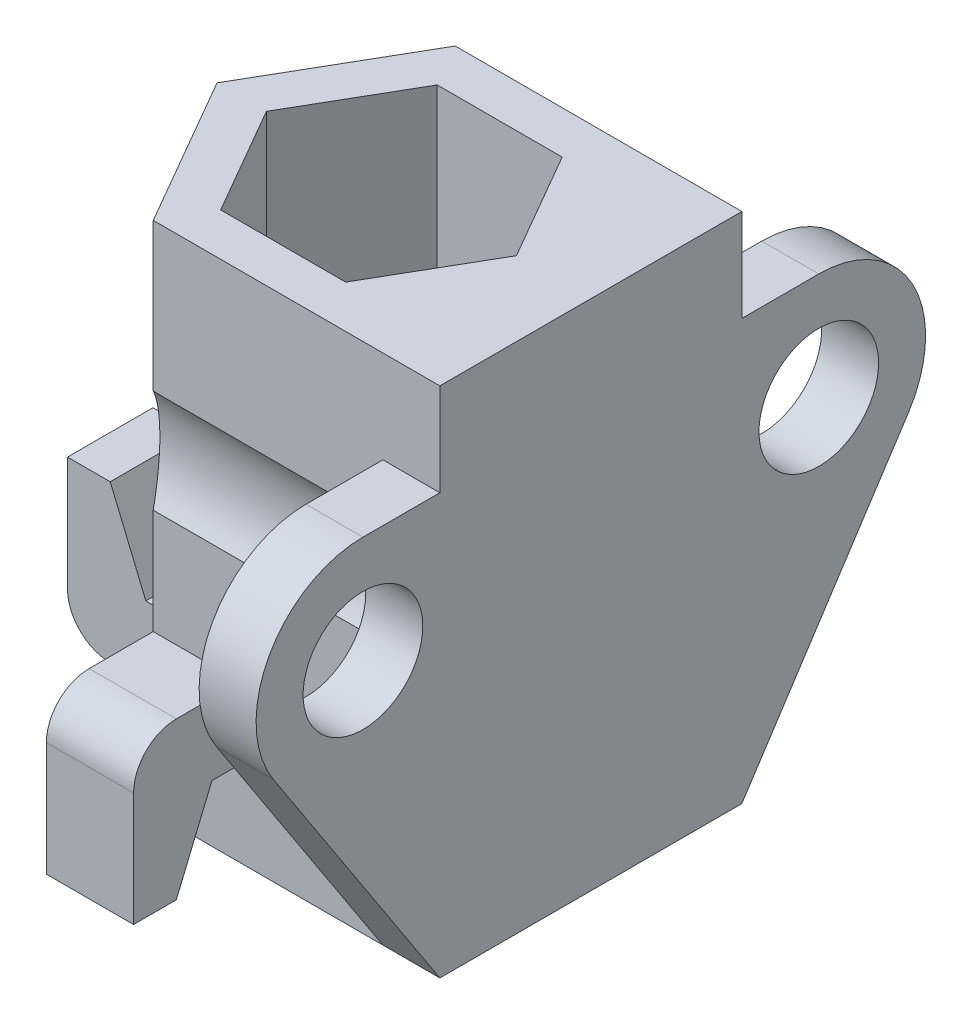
ISO-10303-21;
HEADER;
FILE_DESCRIPTION(('STEP AP214'),'2;1');
FILE_NAME('part.step','',(''),(''),'','','');
FILE_SCHEMA(('AUTOMOTIVE_DESIGN { 1 0 10303 214 1 1 1 1 }'));
ENDSEC;
DATA;
#1=APPLICATION_CONTEXT('core data for automotive mechanical design processes');
#2=APPLICATION_PROTOCOL_DEFINITION('international standard','automotive_design',2000,#1);
#3=PRODUCT_CONTEXT('',#1,'mechanical');
#4=PRODUCT('Part','Part','',(#3));
#5=PRODUCT_RELATED_PRODUCT_CATEGORY('part','',(#4));
#6=PRODUCT_DEFINITION_FORMATION('','',#4);
#7=PRODUCT_DEFINITION_CONTEXT('part definition',#1,'design');
#8=PRODUCT_DEFINITION('design','',#6,#7);
#9=PRODUCT_DEFINITION_SHAPE('','',#8);
#10=(LENGTH_UNIT() NAMED_UNIT(*) SI_UNIT(.MILLI.,.METRE.));
#11=(NAMED_UNIT(*) PLANE_ANGLE_UNIT() SI_UNIT($,.RADIAN.));
#12=(NAMED_UNIT(*) SI_UNIT($,.STERADIAN.) SOLID_ANGLE_UNIT());
#13=UNCERTAINTY_MEASURE_WITH_UNIT(LENGTH_MEASURE(1.E-05),#10,'distance_accuracy_value','');
#14=(GEOMETRIC_REPRESENTATION_CONTEXT(3) GLOBAL_UNCERTAINTY_ASSIGNED_CONTEXT((#13)) GLOBAL_UNIT_ASSIGNED_CONTEXT((#10,
#11,#12)) REPRESENTATION_CONTEXT('',''));
#15=CARTESIAN_POINT('',(0.,0.,0.));
#16=DIRECTION('',(0.,0.,1.));
#17=DIRECTION('',(1.,0.,0.));
#18=AXIS2_PLACEMENT_3D('',#15,#16,#17);
#19=CARTESIAN_POINT('',(-6.11991285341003,18.,0.));
#20=DIRECTION('',(0.866025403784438,0.,-0.5));
#21=DIRECTION('',(-0.5,0.,-0.866025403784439));
#22=AXIS2_PLACEMENT_3D('',#19,#20,#21);
#23=PLANE('',#22);
#24=CARTESIAN_POINT('',(-1.50111069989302,11.,8.));
#25=DIRECTION('',(0.866025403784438,0.,-0.5));
#26=DIRECTION('',(0.5,0.,0.866025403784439));
#27=AXIS2_PLACEMENT_3D('',#24,#25,#26);
#28=ELLIPSE('',#27,3.75277674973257,3.25);
#29=CARTESIAN_POINT('',(-3.05995642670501,12.8090052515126,5.3));
#30=VERTEX_POINT('',#29);
#31=CARTESIAN_POINT('',(-3.05995642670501,9.19099474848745,5.3));
#32=VERTEX_POINT('',#31);
#33=EDGE_CURVE('E666',#30,#32,#28,.F.);
#34=ORIENTED_EDGE('',*,*,#33,.F.);
#35=DIRECTION('',(0.,-1.,0.));
#36=VECTOR('',#35,1.);
#37=CARTESIAN_POINT('',(-3.05995642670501,18.,5.3));
#38=LINE('',#37,#36);
#39=CARTESIAN_POINT('',(-3.05995642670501,18.,5.3));
#40=VERTEX_POINT('',#39);
#41=EDGE_CURVE('E351',#40,#30,#38,.T.);
#42=ORIENTED_EDGE('',*,*,#41,.F.);
#43=DIRECTION('',(0.5,0.,0.866025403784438));
#44=VECTOR('',#43,1.);
#45=CARTESIAN_POINT('',(-6.11991285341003,18.,0.));
#46=LINE('',#45,#44);
#47=CARTESIAN_POINT('',(-6.11991285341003,18.,0.));
#48=VERTEX_POINT('',#47);
#49=EDGE_CURVE('E571',#48,#40,#46,.T.);
#50=ORIENTED_EDGE('',*,*,#49,.F.);
#51=DIRECTION('',(0.,-1.,0.));
#52=VECTOR('',#51,1.);
#53=CARTESIAN_POINT('',(-6.11991285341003,18.,0.));
#54=LINE('',#53,#52);
#55=CARTESIAN_POINT('',(-6.11991285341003,2.5,0.));
#56=VERTEX_POINT('',#55);
#57=EDGE_CURVE('E419',#48,#56,#54,.T.);
#58=ORIENTED_EDGE('',*,*,#57,.T.);
#59=DIRECTION('',(0.5,0.,0.866025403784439));
#60=VECTOR('',#59,1.);
#61=CARTESIAN_POINT('',(124994.760546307,2.5,216507.87594611));
#62=LINE('',#61,#60);
#63=CARTESIAN_POINT('',(-5.25388744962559,2.5,1.5));
#64=VERTEX_POINT('',#63);
#65=EDGE_CURVE('E715',#56,#64,#62,.T.);
#66=ORIENTED_EDGE('',*,*,#65,.T.);
#67=DIRECTION('',(0.,-1.,0.));
#68=VECTOR('',#67,1.);
#69=CARTESIAN_POINT('',(-5.25388744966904,2.5,1.5));
#70=LINE('',#69,#68);
#71=CARTESIAN_POINT('',(-5.25388744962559,0.,1.5));
#72=VERTEX_POINT('',#71);
#73=EDGE_CURVE('E710',#64,#72,#70,.T.);
#74=ORIENTED_EDGE('',*,*,#73,.T.);
#75=DIRECTION('',(0.5,0.,0.866025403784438));
#76=VECTOR('',#75,1.);
#77=CARTESIAN_POINT('',(-6.11991285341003,0.,0.));
#78=LINE('',#77,#76);
#79=CARTESIAN_POINT('',(-3.05995642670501,0.,5.3));
#80=VERTEX_POINT('',#79);
#81=EDGE_CURVE('E395',#72,#80,#78,.T.);
#82=ORIENTED_EDGE('',*,*,#81,.T.);
#83=CARTESIAN_POINT('',(-3.05995642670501,3.,5.3));
#84=VERTEX_POINT('',#83);
#85=EDGE_CURVE('E412',#84,#80,#38,.T.);
#86=ORIENTED_EDGE('',*,*,#85,.F.);
#87=DIRECTION('',(0.,1.,0.));
#88=VECTOR('',#87,1.);
#89=CARTESIAN_POINT('',(-3.05995642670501,5.5,5.3));
#90=LINE('',#89,#88);
#91=CARTESIAN_POINT('',(-3.05995642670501,5.5,5.3));
#92=VERTEX_POINT('',#91);
#93=EDGE_CURVE('E738',#84,#92,#90,.T.);
#94=ORIENTED_EDGE('',*,*,#93,.T.);
#95=EDGE_CURVE('E420',#32,#92,#38,.T.);
#96=ORIENTED_EDGE('',*,*,#95,.F.);
#97=EDGE_LOOP('',(#34,#42,#50,#58,#66,#74,#82,#86,#94,#96));
#98=FACE_BOUND('',#97,.T.);
#99=ADVANCED_FACE('F37',(#98),#23,.F.);
#100=CARTESIAN_POINT('',(7.,18.,5.3));
#101=DIRECTION('',(0.,0.,-1.));
#102=DIRECTION('',(-1.,0.,0.));
#103=AXIS2_PLACEMENT_3D('',#100,#101,#102);
#104=PLANE('',#103);
#105=DIRECTION('',(1.,0.,0.));
#106=VECTOR('',#105,1.);
#107=CARTESIAN_POINT('',(-6.11991285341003,12.8090052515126,5.3));
#108=LINE('',#107,#106);
#109=CARTESIAN_POINT('',(5.,12.8090052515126,5.3));
#110=VERTEX_POINT('',#109);
#111=EDGE_CURVE('E335',#30,#110,#108,.T.);
#112=ORIENTED_EDGE('',*,*,#111,.T.);
#113=DIRECTION('',(0.,1.,0.));
#114=VECTOR('',#113,1.);
#115=CARTESIAN_POINT('',(5.,14.75,5.3));
#116=LINE('',#115,#114);
#117=CARTESIAN_POINT('',(5.,14.75,5.3));
#118=VERTEX_POINT('',#117);
#119=EDGE_CURVE('E347',#110,#118,#116,.T.);
#120=ORIENTED_EDGE('',*,*,#119,.T.);
#121=DIRECTION('',(1.,0.,0.));
#122=VECTOR('',#121,1.);
#123=CARTESIAN_POINT('',(5.,14.75,5.3));
#124=LINE('',#123,#122);
#125=CARTESIAN_POINT('',(7.,14.75,5.3));
#126=VERTEX_POINT('',#125);
#127=EDGE_CURVE('E630',#118,#126,#124,.T.);
#128=ORIENTED_EDGE('',*,*,#127,.T.);
#129=DIRECTION('',(0.,-1.,0.));
#130=VECTOR('',#129,1.);
#131=CARTESIAN_POINT('',(7.,18.,5.3));
#132=LINE('',#131,#130);
#133=CARTESIAN_POINT('',(7.,18.,5.3));
#134=VERTEX_POINT('',#133);
#135=EDGE_CURVE('E408',#134,#126,#132,.T.);
#136=ORIENTED_EDGE('',*,*,#135,.F.);
#137=DIRECTION('',(1.,0.,0.));
#138=VECTOR('',#137,1.);
#139=CARTESIAN_POINT('',(-3.05995642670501,18.,5.3));
#140=LINE('',#139,#138);
#141=EDGE_CURVE('E572',#40,#134,#140,.T.);
#142=ORIENTED_EDGE('',*,*,#141,.F.);
#143=ORIENTED_EDGE('',*,*,#41,.T.);
#144=EDGE_LOOP('',(#112,#120,#128,#136,#142,#143));
#145=FACE_BOUND('',#144,.T.);
#146=ADVANCED_FACE('F345',(#145),#104,.F.);
#147=DIRECTION('',(1.,0.,0.));
#148=VECTOR('',#147,1.);
#149=CARTESIAN_POINT('',(-6.11991285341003,9.19099474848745,5.3));
#150=LINE('',#149,#148);
#151=CARTESIAN_POINT('',(5.,9.19099474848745,5.3));
#152=VERTEX_POINT('',#151);
#153=EDGE_CURVE('E338',#32,#152,#150,.T.);
#154=ORIENTED_EDGE('',*,*,#153,.F.);
#155=ORIENTED_EDGE('',*,*,#95,.T.);
#156=DIRECTION('',(1.,0.,0.));
#157=VECTOR('',#156,1.);
#158=CARTESIAN_POINT('',(-3.05995642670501,5.5,5.3));
#159=LINE('',#158,#157);
#160=CARTESIAN_POINT('',(0.,5.5,5.3));
#161=VERTEX_POINT('',#160);
#162=EDGE_CURVE('E755',#92,#161,#159,.T.);
#163=ORIENTED_EDGE('',*,*,#162,.T.);
#164=DIRECTION('',(0.,1.,0.));
#165=VECTOR('',#164,1.);
#166=CARTESIAN_POINT('',(0.,5.5,5.3));
#167=LINE('',#166,#165);
#168=CARTESIAN_POINT('',(0.,3.,5.3));
#169=VERTEX_POINT('',#168);
#170=EDGE_CURVE('E727',#169,#161,#167,.T.);
#171=ORIENTED_EDGE('',*,*,#170,.F.);
#172=DIRECTION('',(1.,0.,0.));
#173=VECTOR('',#172,1.);
#174=CARTESIAN_POINT('',(-3.05995642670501,3.,5.3));
#175=LINE('',#174,#173);
#176=EDGE_CURVE('E758',#84,#169,#175,.T.);
#177=ORIENTED_EDGE('',*,*,#176,.F.);
#178=ORIENTED_EDGE('',*,*,#85,.T.);
#179=DIRECTION('',(1.,0.,0.));
#180=VECTOR('',#179,1.);
#181=CARTESIAN_POINT('',(7.,0.,5.3));
#182=LINE('',#181,#180);
#183=CARTESIAN_POINT('',(5.,0.,5.3));
#184=VERTEX_POINT('',#183);
#185=EDGE_CURVE('E397',#80,#184,#182,.T.);
#186=ORIENTED_EDGE('',*,*,#185,.T.);
#187=EDGE_CURVE('E358',#184,#152,#116,.T.);
#188=ORIENTED_EDGE('',*,*,#187,.T.);
#189=EDGE_LOOP('',(#154,#155,#163,#171,#177,#178,#186,#188));
#190=FACE_BOUND('',#189,.T.);
#191=ADVANCED_FACE('F881',(#190),#104,.F.);
#192=CARTESIAN_POINT('',(-3.05995642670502,18.,-5.3));
#193=DIRECTION('',(0.866025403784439,0.,0.5));
#194=DIRECTION('',(0.5,0.,-0.866025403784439));
#195=AXIS2_PLACEMENT_3D('',#192,#193,#194);
#196=PLANE('',#195);
#197=CARTESIAN_POINT('',(-1.50111069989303,11.,-8.));
#198=DIRECTION('',(0.866025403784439,0.,0.5));
#199=DIRECTION('',(0.5,0.,-0.866025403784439));
#200=AXIS2_PLACEMENT_3D('',#197,#198,#199);
#201=ELLIPSE('',#200,3.75277674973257,3.25);
#202=CARTESIAN_POINT('',(-3.05995642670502,9.19099474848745,-5.3));
#203=VERTEX_POINT('',#202);
#204=CARTESIAN_POINT('',(-3.05995642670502,12.8090052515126,-5.3));
#205=VERTEX_POINT('',#204);
#206=EDGE_CURVE('E679',#203,#205,#201,.F.);
#207=ORIENTED_EDGE('',*,*,#206,.F.);
#208=DIRECTION('',(0.,-1.,0.));
#209=VECTOR('',#208,1.);
#210=CARTESIAN_POINT('',(-3.05995642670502,18.,-5.3));
#211=LINE('',#210,#209);
#212=CARTESIAN_POINT('',(-3.05995642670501,5.5,-5.3));
#213=VERTEX_POINT('',#212);
#214=EDGE_CURVE('E427',#203,#213,#211,.T.);
#215=ORIENTED_EDGE('',*,*,#214,.T.);
#216=DIRECTION('',(0.,-1.,0.));
#217=VECTOR('',#216,1.);
#218=CARTESIAN_POINT('',(-3.05995642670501,5.5,-5.3));
#219=LINE('',#218,#217);
#220=CARTESIAN_POINT('',(-3.05995642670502,3.,-5.3));
#221=VERTEX_POINT('',#220);
#222=EDGE_CURVE('E767',#213,#221,#219,.T.);
#223=ORIENTED_EDGE('',*,*,#222,.T.);
#224=CARTESIAN_POINT('',(-3.05995642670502,0.,-5.3));
#225=VERTEX_POINT('',#224);
#226=EDGE_CURVE('E422',#221,#225,#211,.T.);
#227=ORIENTED_EDGE('',*,*,#226,.T.);
#228=DIRECTION('',(-0.5,0.,0.866025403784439));
#229=VECTOR('',#228,1.);
#230=CARTESIAN_POINT('',(-3.05995642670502,0.,-5.3));
#231=LINE('',#230,#229);
#232=CARTESIAN_POINT('',(-5.25388744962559,0.,-1.5));
#233=VERTEX_POINT('',#232);
#234=EDGE_CURVE('E391',#225,#233,#231,.T.);
#235=ORIENTED_EDGE('',*,*,#234,.T.);
#236=DIRECTION('',(0.,1.,0.));
#237=VECTOR('',#236,1.);
#238=CARTESIAN_POINT('',(-5.25388744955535,0.,-1.5));
#239=LINE('',#238,#237);
#240=CARTESIAN_POINT('',(-5.25388744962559,2.5,-1.5));
#241=VERTEX_POINT('',#240);
#242=EDGE_CURVE('E681',#233,#241,#239,.T.);
#243=ORIENTED_EDGE('',*,*,#242,.T.);
#244=DIRECTION('',(-0.5,0.,0.866025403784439));
#245=VECTOR('',#244,1.);
#246=CARTESIAN_POINT('',(124996.059584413,2.5,-216510.12594611));
#247=LINE('',#246,#245);
#248=EDGE_CURVE('E664',#241,#56,#247,.T.);
#249=ORIENTED_EDGE('',*,*,#248,.T.);
#250=ORIENTED_EDGE('',*,*,#57,.F.);
#251=DIRECTION('',(-0.5,0.,0.866025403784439));
#252=VECTOR('',#251,1.);
#253=CARTESIAN_POINT('',(-3.05995642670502,18.,-5.3));
#254=LINE('',#253,#252);
#255=CARTESIAN_POINT('',(-3.05995642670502,18.,-5.3));
#256=VERTEX_POINT('',#255);
#257=EDGE_CURVE('E569',#256,#48,#254,.T.);
#258=ORIENTED_EDGE('',*,*,#257,.F.);
#259=EDGE_CURVE('E406',#256,#205,#211,.T.);
#260=ORIENTED_EDGE('',*,*,#259,.T.);
#261=EDGE_LOOP('',(#207,#215,#223,#227,#235,#243,#249,#250,#258,#260));
#262=FACE_BOUND('',#261,.T.);
#263=ADVANCED_FACE('F661',(#262),#196,.F.);
#264=CARTESIAN_POINT('',(3.05995642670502,18.,-5.3));
#265=DIRECTION('',(0.,0.,1.));
#266=DIRECTION('',(1.,0.,0.));
#267=AXIS2_PLACEMENT_3D('',#264,#265,#266);
#268=PLANE('',#267);
#269=DIRECTION('',(1.,0.,0.));
#270=VECTOR('',#269,1.);
#271=CARTESIAN_POINT('',(-6.11991285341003,9.19099474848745,-5.3));
#272=LINE('',#271,#270);
#273=CARTESIAN_POINT('',(5.,9.19099474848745,-5.3));
#274=VERTEX_POINT('',#273);
#275=EDGE_CURVE('E670',#203,#274,#272,.T.);
#276=ORIENTED_EDGE('',*,*,#275,.T.);
#277=DIRECTION('',(0.,-1.,0.));
#278=VECTOR('',#277,1.);
#279=CARTESIAN_POINT('',(5.,14.75,-5.3));
#280=LINE('',#279,#278);
#281=CARTESIAN_POINT('',(5.,0.,-5.3));
#282=VERTEX_POINT('',#281);
#283=EDGE_CURVE('E368',#274,#282,#280,.T.);
#284=ORIENTED_EDGE('',*,*,#283,.T.);
#285=DIRECTION('',(-1.,0.,0.));
#286=VECTOR('',#285,1.);
#287=CARTESIAN_POINT('',(3.05995642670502,0.,-5.3));
#288=LINE('',#287,#286);
#289=EDGE_CURVE('E379',#282,#225,#288,.T.);
#290=ORIENTED_EDGE('',*,*,#289,.T.);
#291=ORIENTED_EDGE('',*,*,#226,.F.);
#292=DIRECTION('',(1.,0.,0.));
#293=VECTOR('',#292,1.);
#294=CARTESIAN_POINT('',(-3.05995642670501,3.,-5.3));
#295=LINE('',#294,#293);
#296=CARTESIAN_POINT('',(0.,3.,-5.3));
#297=VERTEX_POINT('',#296);
#298=EDGE_CURVE('E784',#221,#297,#295,.T.);
#299=ORIENTED_EDGE('',*,*,#298,.T.);
#300=DIRECTION('',(0.,-1.,0.));
#301=VECTOR('',#300,1.);
#302=CARTESIAN_POINT('',(0.,5.5,-5.3));
#303=LINE('',#302,#301);
#304=CARTESIAN_POINT('',(0.,5.5,-5.3));
#305=VERTEX_POINT('',#304);
#306=EDGE_CURVE('E757',#305,#297,#303,.T.);
#307=ORIENTED_EDGE('',*,*,#306,.F.);
#308=DIRECTION('',(1.,0.,0.));
#309=VECTOR('',#308,1.);
#310=CARTESIAN_POINT('',(-3.05995642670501,5.5,-5.3));
#311=LINE('',#310,#309);
#312=EDGE_CURVE('E800',#213,#305,#311,.T.);
#313=ORIENTED_EDGE('',*,*,#312,.F.);
#314=ORIENTED_EDGE('',*,*,#214,.F.);
#315=EDGE_LOOP('',(#276,#284,#290,#291,#299,#307,#313,#314));
#316=FACE_BOUND('',#315,.T.);
#317=ADVANCED_FACE('F824',(#316),#268,.F.);
#318=DIRECTION('',(1.,0.,0.));
#319=VECTOR('',#318,1.);
#320=CARTESIAN_POINT('',(-6.11991285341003,12.8090052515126,-5.3));
#321=LINE('',#320,#319);
#322=CARTESIAN_POINT('',(5.,12.8090052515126,-5.3));
#323=VERTEX_POINT('',#322);
#324=EDGE_CURVE('E676',#205,#323,#321,.T.);
#325=ORIENTED_EDGE('',*,*,#324,.F.);
#326=ORIENTED_EDGE('',*,*,#259,.F.);
#327=DIRECTION('',(-1.,0.,0.));
#328=VECTOR('',#327,1.);
#329=CARTESIAN_POINT('',(3.05995642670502,18.,-5.3));
#330=LINE('',#329,#328);
#331=CARTESIAN_POINT('',(7.,18.,-5.3));
#332=VERTEX_POINT('',#331);
#333=EDGE_CURVE('E567',#332,#256,#330,.T.);
#334=ORIENTED_EDGE('',*,*,#333,.F.);
#335=DIRECTION('',(0.,-1.,0.));
#336=VECTOR('',#335,1.);
#337=CARTESIAN_POINT('',(7.,18.,-5.3));
#338=LINE('',#337,#336);
#339=CARTESIAN_POINT('',(7.,14.75,-5.3));
#340=VERTEX_POINT('',#339);
#341=EDGE_CURVE('E413',#332,#340,#338,.T.);
#342=ORIENTED_EDGE('',*,*,#341,.T.);
#343=DIRECTION('',(1.,0.,0.));
#344=VECTOR('',#343,1.);
#345=CARTESIAN_POINT('',(5.,14.75,-5.3));
#346=LINE('',#345,#344);
#347=CARTESIAN_POINT('',(5.,14.75,-5.3));
#348=VERTEX_POINT('',#347);
#349=EDGE_CURVE('E591',#348,#340,#346,.T.);
#350=ORIENTED_EDGE('',*,*,#349,.F.);
#351=EDGE_CURVE('E586',#348,#323,#280,.T.);
#352=ORIENTED_EDGE('',*,*,#351,.T.);
#353=EDGE_LOOP('',(#325,#326,#334,#342,#350,#352));
#354=FACE_BOUND('',#353,.T.);
#355=ADVANCED_FACE('F658',(#354),#268,.F.);
#356=CARTESIAN_POINT('',(0.,18.,0.));
#357=DIRECTION('',(0.,-1.,0.));
#358=DIRECTION('',(0.,0.,-1.));
#359=AXIS2_PLACEMENT_3D('',#356,#357,#358);
#360=PLANE('',#359);
#361=ORIENTED_EDGE('',*,*,#333,.T.);
#362=ORIENTED_EDGE('',*,*,#257,.T.);
#363=ORIENTED_EDGE('',*,*,#49,.T.);
#364=ORIENTED_EDGE('',*,*,#141,.T.);
#365=DIRECTION('',(0.,0.,-1.));
#366=VECTOR('',#365,1.);
#367=CARTESIAN_POINT('',(7.,18.,-5.3));
#368=LINE('',#367,#366);
#369=EDGE_CURVE('E389',#134,#332,#368,.T.);
#370=ORIENTED_EDGE('',*,*,#369,.T.);
#371=EDGE_LOOP('',(#361,#362,#363,#364,#370));
#372=FACE_BOUND('',#371,.T.);
#373=DIRECTION('',(0.5,0.,-0.866025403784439));
#374=VECTOR('',#373,1.);
#375=CARTESIAN_POINT('',(2.19393102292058,18.,3.8));
#376=LINE('',#375,#374);
#377=CARTESIAN_POINT('',(2.19393102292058,18.,3.8));
#378=VERTEX_POINT('',#377);
#379=CARTESIAN_POINT('',(4.38786204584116,18.,0.));
#380=VERTEX_POINT('',#379);
#381=EDGE_CURVE('E629',#378,#380,#376,.T.);
#382=ORIENTED_EDGE('',*,*,#381,.F.);
#383=DIRECTION('',(1.,0.,0.));
#384=VECTOR('',#383,1.);
#385=CARTESIAN_POINT('',(-2.19393102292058,18.,3.8));
#386=LINE('',#385,#384);
#387=CARTESIAN_POINT('',(-2.19393102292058,18.,3.8));
#388=VERTEX_POINT('',#387);
#389=EDGE_CURVE('E536',#388,#378,#386,.T.);
#390=ORIENTED_EDGE('',*,*,#389,.F.);
#391=DIRECTION('',(0.5,0.,0.866025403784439));
#392=VECTOR('',#391,1.);
#393=CARTESIAN_POINT('',(-4.38786204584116,18.,0.));
#394=LINE('',#393,#392);
#395=CARTESIAN_POINT('',(-4.38786204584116,18.,0.));
#396=VERTEX_POINT('',#395);
#397=EDGE_CURVE('E1434',#396,#388,#394,.T.);
#398=ORIENTED_EDGE('',*,*,#397,.F.);
#399=DIRECTION('',(-0.5,0.,0.866025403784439));
#400=VECTOR('',#399,1.);
#401=CARTESIAN_POINT('',(-2.19393102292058,18.,-3.8));
#402=LINE('',#401,#400);
#403=CARTESIAN_POINT('',(-2.19393102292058,18.,-3.8));
#404=VERTEX_POINT('',#403);
#405=EDGE_CURVE('E558',#404,#396,#402,.T.);
#406=ORIENTED_EDGE('',*,*,#405,.F.);
#407=DIRECTION('',(-1.,0.,0.));
#408=VECTOR('',#407,1.);
#409=CARTESIAN_POINT('',(2.19393102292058,18.,-3.8));
#410=LINE('',#409,#408);
#411=CARTESIAN_POINT('',(2.19393102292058,18.,-3.8));
#412=VERTEX_POINT('',#411);
#413=EDGE_CURVE('E1432',#412,#404,#410,.T.);
#414=ORIENTED_EDGE('',*,*,#413,.F.);
#415=DIRECTION('',(-0.5,0.,-0.866025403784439));
#416=VECTOR('',#415,1.);
#417=CARTESIAN_POINT('',(4.38786204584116,18.,0.));
#418=LINE('',#417,#416);
#419=EDGE_CURVE('E1430',#380,#412,#418,.T.);
#420=ORIENTED_EDGE('',*,*,#419,.F.);
#421=EDGE_LOOP('',(#382,#390,#398,#406,#414,#420));
#422=FACE_BOUND('',#421,.T.);
#423=ADVANCED_FACE('F659',(#372,#422),#360,.F.);
#424=CARTESIAN_POINT('',(0.,0.,0.));
#425=DIRECTION('',(0.,-1.,0.));
#426=DIRECTION('',(0.,0.,-1.));
#427=AXIS2_PLACEMENT_3D('',#424,#425,#426);
#428=PLANE('',#427);
#429=DIRECTION('',(0.5,0.,0.866025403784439));
#430=VECTOR('',#429,1.);
#431=CARTESIAN_POINT('',(-3.94041558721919,0.,2.275));
#432=LINE('',#431,#430);
#433=CARTESIAN_POINT('',(-5.25388744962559,0.,0.));
#434=VERTEX_POINT('',#433);
#435=CARTESIAN_POINT('',(-2.62694372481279,0.,4.55));
#436=VERTEX_POINT('',#435);
#437=EDGE_CURVE('E485',#434,#436,#432,.T.);
#438=ORIENTED_EDGE('',*,*,#437,.T.);
#439=DIRECTION('',(1.,0.,0.));
#440=VECTOR('',#439,1.);
#441=CARTESIAN_POINT('',(0.,0.,4.54999999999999));
#442=LINE('',#441,#440);
#443=CARTESIAN_POINT('',(2.62694372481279,0.,4.54999999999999));
#444=VERTEX_POINT('',#443);
#445=EDGE_CURVE('E487',#436,#444,#442,.T.);
#446=ORIENTED_EDGE('',*,*,#445,.T.);
#447=DIRECTION('',(0.5,0.,-0.866025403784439));
#448=VECTOR('',#447,1.);
#449=CARTESIAN_POINT('',(3.94041558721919,0.,2.275));
#450=LINE('',#449,#448);
#451=CARTESIAN_POINT('',(5.25388744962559,0.,0.));
#452=VERTEX_POINT('',#451);
#453=EDGE_CURVE('E371',#444,#452,#450,.T.);
#454=ORIENTED_EDGE('',*,*,#453,.T.);
#455=DIRECTION('',(-0.5,0.,-0.866025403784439));
#456=VECTOR('',#455,1.);
#457=CARTESIAN_POINT('',(3.94041558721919,0.,-2.275));
#458=LINE('',#457,#456);
#459=CARTESIAN_POINT('',(2.62694372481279,0.,-4.54999999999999));
#460=VERTEX_POINT('',#459);
#461=EDGE_CURVE('E474',#452,#460,#458,.T.);
#462=ORIENTED_EDGE('',*,*,#461,.T.);
#463=DIRECTION('',(-1.,0.,0.));
#464=VECTOR('',#463,1.);
#465=CARTESIAN_POINT('',(0.,0.,-4.54999999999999));
#466=LINE('',#465,#464);
#467=CARTESIAN_POINT('',(-2.62694372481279,0.,-4.54999999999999));
#468=VERTEX_POINT('',#467);
#469=EDGE_CURVE('E479',#460,#468,#466,.T.);
#470=ORIENTED_EDGE('',*,*,#469,.T.);
#471=DIRECTION('',(-0.5,0.,0.866025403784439));
#472=VECTOR('',#471,1.);
#473=CARTESIAN_POINT('',(-3.94041558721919,0.,-2.275));
#474=LINE('',#473,#472);
#475=EDGE_CURVE('E481',#468,#434,#474,.T.);
#476=ORIENTED_EDGE('',*,*,#475,.T.);
#477=EDGE_LOOP('',(#438,#446,#454,#462,#470,#476));
#478=FACE_BOUND('',#477,.T.);
#479=DIRECTION('',(-1.,0.,0.));
#480=VECTOR('',#479,1.);
#481=CARTESIAN_POINT('',(500000.,0.,1.5));
#482=LINE('',#481,#480);
#483=CARTESIAN_POINT('',(-8.36991285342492,0.,1.5));
#484=VERTEX_POINT('',#483);
#485=EDGE_CURVE('E719',#72,#484,#482,.T.);
#486=ORIENTED_EDGE('',*,*,#485,.T.);
#487=DIRECTION('',(0.,0.,1.));
#488=VECTOR('',#487,1.);
#489=CARTESIAN_POINT('',(-8.36991285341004,0.,0.));
#490=LINE('',#489,#488);
#491=CARTESIAN_POINT('',(-8.36991285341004,0.,-1.5));
#492=VERTEX_POINT('',#491);
#493=EDGE_CURVE('E458',#484,#492,#490,.F.);
#494=ORIENTED_EDGE('',*,*,#493,.T.);
#495=DIRECTION('',(1.,0.,0.));
#496=VECTOR('',#495,1.);
#497=CARTESIAN_POINT('',(-6.11991285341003,0.,-1.5));
#498=LINE('',#497,#496);
#499=EDGE_CURVE('E705',#492,#233,#498,.T.);
#500=ORIENTED_EDGE('',*,*,#499,.T.);
#501=ORIENTED_EDGE('',*,*,#234,.F.);
#502=ORIENTED_EDGE('',*,*,#289,.F.);
#503=CARTESIAN_POINT('',(7.,0.,-5.3));
#504=VERTEX_POINT('',#503);
#505=EDGE_CURVE('E383',#504,#282,#288,.T.);
#506=ORIENTED_EDGE('',*,*,#505,.F.);
#507=DIRECTION('',(0.,0.,-1.));
#508=VECTOR('',#507,1.);
#509=CARTESIAN_POINT('',(7.,0.,-5.3));
#510=LINE('',#509,#508);
#511=CARTESIAN_POINT('',(7.,0.,5.3));
#512=VERTEX_POINT('',#511);
#513=EDGE_CURVE('E400',#512,#504,#510,.T.);
#514=ORIENTED_EDGE('',*,*,#513,.F.);
#515=DIRECTION('',(1.,0.,0.));
#516=VECTOR('',#515,1.);
#517=CARTESIAN_POINT('',(5.,0.,5.3));
#518=LINE('',#517,#516);
#519=EDGE_CURVE('E636',#184,#512,#518,.T.);
#520=ORIENTED_EDGE('',*,*,#519,.F.);
#521=ORIENTED_EDGE('',*,*,#185,.F.);
#522=ORIENTED_EDGE('',*,*,#81,.F.);
#523=EDGE_LOOP('',(#486,#494,#500,#501,#502,#506,#514,#520,#521,#522));
#524=FACE_BOUND('',#523,.T.);
#525=ADVANCED_FACE('F835',(#478,#524),#428,.T.);
#526=CARTESIAN_POINT('',(7.,18.,-5.3));
#527=DIRECTION('',(-1.,0.,0.));
#528=DIRECTION('',(0.,0.,1.));
#529=AXIS2_PLACEMENT_3D('',#526,#527,#528);
#530=PLANE('',#529);
#531=ORIENTED_EDGE('',*,*,#513,.T.);
#532=DIRECTION('',(0.,0.83747753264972,-0.546471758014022));
#533=VECTOR('',#532,1.);
#534=CARTESIAN_POINT('',(7.,8.95073090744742,-11.1405407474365));
#535=LINE('',#534,#533);
#536=CARTESIAN_POINT('',(7.,8.95073090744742,-11.1405407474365));
#537=VERTEX_POINT('',#536);
#538=EDGE_CURVE('E604',#504,#537,#535,.T.);
#539=ORIENTED_EDGE('',*,*,#538,.T.);
#540=CARTESIAN_POINT('',(7.,11.,-8.));
#541=DIRECTION('',(1.,0.,0.));
#542=DIRECTION('',(0.,0.,1.));
#543=AXIS2_PLACEMENT_3D('',#540,#541,#542);
#544=CIRCLE('',#543,3.75);
#545=CARTESIAN_POINT('',(7.,14.75,-8.));
#546=VERTEX_POINT('',#545);
#547=EDGE_CURVE('E598',#537,#546,#544,.T.);
#548=ORIENTED_EDGE('',*,*,#547,.T.);
#549=DIRECTION('',(0.,0.,1.));
#550=VECTOR('',#549,1.);
#551=CARTESIAN_POINT('',(7.,14.75,-8.));
#552=LINE('',#551,#550);
#553=EDGE_CURVE('E602',#546,#340,#552,.T.);
#554=ORIENTED_EDGE('',*,*,#553,.T.);
#555=ORIENTED_EDGE('',*,*,#341,.F.);
#556=ORIENTED_EDGE('',*,*,#369,.F.);
#557=ORIENTED_EDGE('',*,*,#135,.T.);
#558=DIRECTION('',(0.,0.,1.));
#559=VECTOR('',#558,1.);
#560=CARTESIAN_POINT('',(7.,14.75,8.));
#561=LINE('',#560,#559);
#562=CARTESIAN_POINT('',(7.,14.75,8.));
#563=VERTEX_POINT('',#562);
#564=EDGE_CURVE('E414',#126,#563,#561,.T.);
#565=ORIENTED_EDGE('',*,*,#564,.T.);
#566=CARTESIAN_POINT('',(7.,11.,8.));
#567=DIRECTION('',(1.,0.,0.));
#568=DIRECTION('',(0.,0.,-1.));
#569=AXIS2_PLACEMENT_3D('',#566,#567,#568);
#570=CIRCLE('',#569,3.75);
#571=CARTESIAN_POINT('',(7.,8.95073090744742,11.1405407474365));
#572=VERTEX_POINT('',#571);
#573=EDGE_CURVE('E615',#563,#572,#570,.T.);
#574=ORIENTED_EDGE('',*,*,#573,.T.);
#575=DIRECTION('',(0.,-0.83747753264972,-0.546471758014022));
#576=VECTOR('',#575,1.);
#577=CARTESIAN_POINT('',(7.,8.95073090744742,11.1405407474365));
#578=LINE('',#577,#576);
#579=EDGE_CURVE('E624',#572,#512,#578,.T.);
#580=ORIENTED_EDGE('',*,*,#579,.T.);
#581=EDGE_LOOP('',(#531,#539,#548,#554,#555,#556,#557,#565,#574,#580));
#582=FACE_BOUND('',#581,.T.);
#583=CARTESIAN_POINT('',(7.,11.,8.));
#584=DIRECTION('',(1.,0.,0.));
#585=DIRECTION('',(0.,0.,-1.));
#586=AXIS2_PLACEMENT_3D('',#583,#584,#585);
#587=CIRCLE('',#586,2.1);
#588=CARTESIAN_POINT('',(7.,11.,5.9));
#589=VERTEX_POINT('',#588);
#590=EDGE_CURVE('E610',#589,#589,#587,.T.);
#591=ORIENTED_EDGE('',*,*,#590,.F.);
#592=EDGE_LOOP('',(#591));
#593=FACE_BOUND('',#592,.T.);
#594=CARTESIAN_POINT('',(7.,11.,-8.));
#595=DIRECTION('',(1.,0.,0.));
#596=DIRECTION('',(0.,0.,1.));
#597=AXIS2_PLACEMENT_3D('',#594,#595,#596);
#598=CIRCLE('',#597,2.1);
#599=CARTESIAN_POINT('',(7.,11.,-5.9));
#600=VERTEX_POINT('',#599);
#601=EDGE_CURVE('E803',#600,#600,#598,.T.);
#602=ORIENTED_EDGE('',*,*,#601,.F.);
#603=EDGE_LOOP('',(#602));
#604=FACE_BOUND('',#603,.T.);
#605=ADVANCED_FACE('F651',(#582,#593,#604),#530,.F.);
#606=CARTESIAN_POINT('',(2.19393102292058,18.,3.8));
#607=DIRECTION('',(-0.866025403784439,0.,-0.5));
#608=DIRECTION('',(-0.5,0.,0.866025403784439));
#609=AXIS2_PLACEMENT_3D('',#606,#607,#608);
#610=PLANE('',#609);
#611=DIRECTION('',(0.,-1.,0.));
#612=VECTOR('',#611,1.);
#613=CARTESIAN_POINT('',(4.38786204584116,18.,0.));
#614=LINE('',#613,#612);
#615=CARTESIAN_POINT('',(4.38786204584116,1.25,0.));
#616=VERTEX_POINT('',#615);
#617=EDGE_CURVE('E384',#380,#616,#614,.T.);
#618=ORIENTED_EDGE('',*,*,#617,.T.);
#619=DIRECTION('',(-0.5,0.,0.866025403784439));
#620=VECTOR('',#619,1.);
#621=CARTESIAN_POINT('',(2.19393102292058,1.25,3.8));
#622=LINE('',#621,#620);
#623=CARTESIAN_POINT('',(2.19393102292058,1.25,3.8));
#624=VERTEX_POINT('',#623);
#625=EDGE_CURVE('E11',#616,#624,#622,.T.);
#626=ORIENTED_EDGE('',*,*,#625,.T.);
#627=DIRECTION('',(0.,-1.,0.));
#628=VECTOR('',#627,1.);
#629=CARTESIAN_POINT('',(2.19393102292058,18.,3.8));
#630=LINE('',#629,#628);
#631=EDGE_CURVE('E529',#378,#624,#630,.T.);
#632=ORIENTED_EDGE('',*,*,#631,.F.);
#633=ORIENTED_EDGE('',*,*,#381,.T.);
#634=EDGE_LOOP('',(#618,#626,#632,#633));
#635=FACE_BOUND('',#634,.T.);
#636=ADVANCED_FACE('F528',(#635),#610,.T.);
#637=CARTESIAN_POINT('',(4.38786204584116,18.,0.));
#638=DIRECTION('',(-0.866025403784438,0.,0.5));
#639=DIRECTION('',(0.5,0.,0.866025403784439));
#640=AXIS2_PLACEMENT_3D('',#637,#638,#639);
#641=PLANE('',#640);
#642=DIRECTION('',(0.,-1.,0.));
#643=VECTOR('',#642,1.);
#644=CARTESIAN_POINT('',(2.19393102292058,18.,-3.8));
#645=LINE('',#644,#643);
#646=CARTESIAN_POINT('',(2.19393102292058,1.25,-3.8));
#647=VERTEX_POINT('',#646);
#648=EDGE_CURVE('E561',#412,#647,#645,.T.);
#649=ORIENTED_EDGE('',*,*,#648,.T.);
#650=DIRECTION('',(0.5,0.,0.866025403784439));
#651=VECTOR('',#650,1.);
#652=CARTESIAN_POINT('',(4.38786204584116,1.25,0.));
#653=LINE('',#652,#651);
#654=EDGE_CURVE('E46',#647,#616,#653,.T.);
#655=ORIENTED_EDGE('',*,*,#654,.T.);
#656=ORIENTED_EDGE('',*,*,#617,.F.);
#657=ORIENTED_EDGE('',*,*,#419,.T.);
#658=EDGE_LOOP('',(#649,#655,#656,#657));
#659=FACE_BOUND('',#658,.T.);
#660=ADVANCED_FACE('F1020',(#659),#641,.T.);
#661=CARTESIAN_POINT('',(2.19393102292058,18.,-3.8));
#662=DIRECTION('',(0.,0.,1.));
#663=DIRECTION('',(1.,0.,0.));
#664=AXIS2_PLACEMENT_3D('',#661,#662,#663);
#665=PLANE('',#664);
#666=DIRECTION('',(0.,-1.,0.));
#667=VECTOR('',#666,1.);
#668=CARTESIAN_POINT('',(-2.19393102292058,18.,-3.8));
#669=LINE('',#668,#667);
#670=CARTESIAN_POINT('',(-2.19393102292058,1.25,-3.8));
#671=VERTEX_POINT('',#670);
#672=EDGE_CURVE('E559',#404,#671,#669,.T.);
#673=ORIENTED_EDGE('',*,*,#672,.T.);
#674=DIRECTION('',(1.,0.,0.));
#675=VECTOR('',#674,1.);
#676=CARTESIAN_POINT('',(2.19393102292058,1.25,-3.8));
#677=LINE('',#676,#675);
#678=EDGE_CURVE('E61',#671,#647,#677,.T.);
#679=ORIENTED_EDGE('',*,*,#678,.T.);
#680=ORIENTED_EDGE('',*,*,#648,.F.);
#681=ORIENTED_EDGE('',*,*,#413,.T.);
#682=EDGE_LOOP('',(#673,#679,#680,#681));
#683=FACE_BOUND('',#682,.T.);
#684=ADVANCED_FACE('F1017',(#683),#665,.T.);
#685=CARTESIAN_POINT('',(-2.19393102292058,18.,-3.8));
#686=DIRECTION('',(0.866025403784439,0.,0.5));
#687=DIRECTION('',(0.5,0.,-0.866025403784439));
#688=AXIS2_PLACEMENT_3D('',#685,#686,#687);
#689=PLANE('',#688);
#690=DIRECTION('',(0.,-1.,0.));
#691=VECTOR('',#690,1.);
#692=CARTESIAN_POINT('',(-4.38786204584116,18.,0.));
#693=LINE('',#692,#691);
#694=CARTESIAN_POINT('',(-4.38786204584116,1.25,0.));
#695=VERTEX_POINT('',#694);
#696=EDGE_CURVE('E552',#396,#695,#693,.T.);
#697=ORIENTED_EDGE('',*,*,#696,.T.);
#698=DIRECTION('',(0.5,0.,-0.866025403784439));
#699=VECTOR('',#698,1.);
#700=CARTESIAN_POINT('',(-2.19393102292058,1.25,-3.8));
#701=LINE('',#700,#699);
#702=EDGE_CURVE('E494',#695,#671,#701,.T.);
#703=ORIENTED_EDGE('',*,*,#702,.T.);
#704=ORIENTED_EDGE('',*,*,#672,.F.);
#705=ORIENTED_EDGE('',*,*,#405,.T.);
#706=EDGE_LOOP('',(#697,#703,#704,#705));
#707=FACE_BOUND('',#706,.T.);
#708=ADVANCED_FACE('F555',(#707),#689,.T.);
#709=CARTESIAN_POINT('',(-4.38786204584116,18.,0.));
#710=DIRECTION('',(0.866025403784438,0.,-0.5));
#711=DIRECTION('',(-0.5,0.,-0.866025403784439));
#712=AXIS2_PLACEMENT_3D('',#709,#710,#711);
#713=PLANE('',#712);
#714=DIRECTION('',(0.,-1.,0.));
#715=VECTOR('',#714,1.);
#716=CARTESIAN_POINT('',(-2.19393102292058,18.,3.8));
#717=LINE('',#716,#715);
#718=CARTESIAN_POINT('',(-2.19393102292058,1.25,3.8));
#719=VERTEX_POINT('',#718);
#720=EDGE_CURVE('E537',#388,#719,#717,.T.);
#721=ORIENTED_EDGE('',*,*,#720,.T.);
#722=DIRECTION('',(-0.5,0.,-0.866025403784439));
#723=VECTOR('',#722,1.);
#724=CARTESIAN_POINT('',(-4.38786204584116,1.25,0.));
#725=LINE('',#724,#723);
#726=EDGE_CURVE('E492',#719,#695,#725,.T.);
#727=ORIENTED_EDGE('',*,*,#726,.T.);
#728=ORIENTED_EDGE('',*,*,#696,.F.);
#729=ORIENTED_EDGE('',*,*,#397,.T.);
#730=EDGE_LOOP('',(#721,#727,#728,#729));
#731=FACE_BOUND('',#730,.T.);
#732=ADVANCED_FACE('F550',(#731),#713,.T.);
#733=CARTESIAN_POINT('',(-2.19393102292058,18.,3.8));
#734=DIRECTION('',(0.,0.,-1.));
#735=DIRECTION('',(-1.,0.,0.));
#736=AXIS2_PLACEMENT_3D('',#733,#734,#735);
#737=PLANE('',#736);
#738=ORIENTED_EDGE('',*,*,#631,.T.);
#739=DIRECTION('',(-1.,0.,0.));
#740=VECTOR('',#739,1.);
#741=CARTESIAN_POINT('',(-2.19393102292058,1.25,3.8));
#742=LINE('',#741,#740);
#743=EDGE_CURVE('E489',#624,#719,#742,.T.);
#744=ORIENTED_EDGE('',*,*,#743,.T.);
#745=ORIENTED_EDGE('',*,*,#720,.F.);
#746=ORIENTED_EDGE('',*,*,#389,.T.);
#747=EDGE_LOOP('',(#738,#744,#745,#746));
#748=FACE_BOUND('',#747,.T.);
#749=ADVANCED_FACE('F533',(#748),#737,.T.);
#750=CARTESIAN_POINT('',(5.,11.,8.));
#751=DIRECTION('',(1.,0.,0.));
#752=DIRECTION('',(0.,0.,-1.));
#753=AXIS2_PLACEMENT_3D('',#750,#751,#752);
#754=CYLINDRICAL_SURFACE('',#753,3.75);
#755=ORIENTED_EDGE('',*,*,#573,.F.);
#756=DIRECTION('',(1.,0.,0.));
#757=VECTOR('',#756,1.);
#758=CARTESIAN_POINT('',(5.,14.75,8.));
#759=LINE('',#758,#757);
#760=CARTESIAN_POINT('',(5.,14.75,8.));
#761=VERTEX_POINT('',#760);
#762=EDGE_CURVE('E627',#761,#563,#759,.T.);
#763=ORIENTED_EDGE('',*,*,#762,.F.);
#764=CARTESIAN_POINT('',(5.,11.,8.));
#765=DIRECTION('',(1.,0.,0.));
#766=DIRECTION('',(0.,0.,-1.));
#767=AXIS2_PLACEMENT_3D('',#764,#765,#766);
#768=CIRCLE('',#767,3.75);
#769=CARTESIAN_POINT('',(5.,8.95073090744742,11.1405407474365));
#770=VERTEX_POINT('',#769);
#771=EDGE_CURVE('E363',#761,#770,#768,.T.);
#772=ORIENTED_EDGE('',*,*,#771,.T.);
#773=DIRECTION('',(1.,0.,0.));
#774=VECTOR('',#773,1.);
#775=CARTESIAN_POINT('',(5.,8.95073090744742,11.1405407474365));
#776=LINE('',#775,#774);
#777=EDGE_CURVE('E621',#770,#572,#776,.T.);
#778=ORIENTED_EDGE('',*,*,#777,.T.);
#779=EDGE_LOOP('',(#755,#763,#772,#778));
#780=FACE_BOUND('',#779,.T.);
#781=ADVANCED_FACE('F644',(#780),#754,.T.);
#782=CARTESIAN_POINT('',(5.,14.75,8.));
#783=DIRECTION('',(0.,1.,0.));
#784=DIRECTION('',(0.,0.,1.));
#785=AXIS2_PLACEMENT_3D('',#782,#783,#784);
#786=PLANE('',#785);
#787=ORIENTED_EDGE('',*,*,#564,.F.);
#788=ORIENTED_EDGE('',*,*,#127,.F.);
#789=DIRECTION('',(0.,0.,1.));
#790=VECTOR('',#789,1.);
#791=CARTESIAN_POINT('',(5.,14.75,8.));
#792=LINE('',#791,#790);
#793=EDGE_CURVE('E357',#118,#761,#792,.T.);
#794=ORIENTED_EDGE('',*,*,#793,.T.);
#795=ORIENTED_EDGE('',*,*,#762,.T.);
#796=EDGE_LOOP('',(#787,#788,#794,#795));
#797=FACE_BOUND('',#796,.T.);
#798=ADVANCED_FACE('F654',(#797),#786,.T.);
#799=CARTESIAN_POINT('',(5.,8.95073090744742,11.1405407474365));
#800=DIRECTION('',(0.,-0.546471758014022,0.83747753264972));
#801=DIRECTION('',(0.,-0.83747753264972,-0.546471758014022));
#802=AXIS2_PLACEMENT_3D('',#799,#800,#801);
#803=PLANE('',#802);
#804=ORIENTED_EDGE('',*,*,#579,.F.);
#805=ORIENTED_EDGE('',*,*,#777,.F.);
#806=DIRECTION('',(0.,-0.83747753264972,-0.546471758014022));
#807=VECTOR('',#806,1.);
#808=CARTESIAN_POINT('',(5.,8.95073090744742,11.1405407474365));
#809=LINE('',#808,#807);
#810=EDGE_CURVE('E359',#770,#184,#809,.T.);
#811=ORIENTED_EDGE('',*,*,#810,.T.);
#812=ORIENTED_EDGE('',*,*,#519,.T.);
#813=EDGE_LOOP('',(#804,#805,#811,#812));
#814=FACE_BOUND('',#813,.T.);
#815=ADVANCED_FACE('F647',(#814),#803,.T.);
#816=CARTESIAN_POINT('',(5.,11.,8.));
#817=DIRECTION('',(1.,0.,0.));
#818=DIRECTION('',(0.,0.,-1.));
#819=AXIS2_PLACEMENT_3D('',#816,#817,#818);
#820=PLANE('',#819);
#821=CARTESIAN_POINT('',(5.,11.,8.));
#822=DIRECTION('',(1.,0.,0.));
#823=DIRECTION('',(0.,0.,-1.));
#824=AXIS2_PLACEMENT_3D('',#821,#822,#823);
#825=CIRCLE('',#824,2.1);
#826=CARTESIAN_POINT('',(5.,11.,5.9));
#827=VERTEX_POINT('',#826);
#828=EDGE_CURVE('E612',#827,#827,#825,.T.);
#829=ORIENTED_EDGE('',*,*,#828,.T.);
#830=EDGE_LOOP('',(#829));
#831=FACE_BOUND('',#830,.T.);
#832=ORIENTED_EDGE('',*,*,#771,.F.);
#833=ORIENTED_EDGE('',*,*,#793,.F.);
#834=ORIENTED_EDGE('',*,*,#119,.F.);
#835=CARTESIAN_POINT('',(5.,11.,8.));
#836=DIRECTION('',(-1.,0.,0.));
#837=DIRECTION('',(0.,0.,-1.));
#838=AXIS2_PLACEMENT_3D('',#835,#836,#837);
#839=CIRCLE('',#838,3.25);
#840=EDGE_CURVE('E332',#110,#152,#839,.T.);
#841=ORIENTED_EDGE('',*,*,#840,.T.);
#842=ORIENTED_EDGE('',*,*,#187,.F.);
#843=ORIENTED_EDGE('',*,*,#810,.F.);
#844=EDGE_LOOP('',(#832,#833,#834,#841,#842,#843));
#845=FACE_BOUND('',#844,.T.);
#846=ADVANCED_FACE('F355',(#831,#845),#820,.F.);
#847=CARTESIAN_POINT('',(5.,11.,8.));
#848=DIRECTION('',(1.,0.,0.));
#849=DIRECTION('',(0.,0.,-1.));
#850=AXIS2_PLACEMENT_3D('',#847,#848,#849);
#851=CYLINDRICAL_SURFACE('',#850,2.1);
#852=ORIENTED_EDGE('',*,*,#828,.F.);
#853=EDGE_LOOP('',(#852));
#854=FACE_BOUND('',#853,.T.);
#855=ORIENTED_EDGE('',*,*,#590,.T.);
#856=EDGE_LOOP('',(#855));
#857=FACE_BOUND('',#856,.T.);
#858=ADVANCED_FACE('F998',(#854,#857),#851,.F.);
#859=CARTESIAN_POINT('',(5.,11.,-8.));
#860=DIRECTION('',(1.,0.,0.));
#861=DIRECTION('',(0.,0.,-1.));
#862=AXIS2_PLACEMENT_3D('',#859,#860,#861);
#863=CYLINDRICAL_SURFACE('',#862,3.75);
#864=ORIENTED_EDGE('',*,*,#547,.F.);
#865=DIRECTION('',(1.,0.,0.));
#866=VECTOR('',#865,1.);
#867=CARTESIAN_POINT('',(5.,8.95073090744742,-11.1405407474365));
#868=LINE('',#867,#866);
#869=CARTESIAN_POINT('',(5.,8.95073090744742,-11.1405407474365));
#870=VERTEX_POINT('',#869);
#871=EDGE_CURVE('E608',#870,#537,#868,.T.);
#872=ORIENTED_EDGE('',*,*,#871,.F.);
#873=CARTESIAN_POINT('',(5.,11.,-8.));
#874=DIRECTION('',(1.,0.,0.));
#875=DIRECTION('',(0.,0.,1.));
#876=AXIS2_PLACEMENT_3D('',#873,#874,#875);
#877=CIRCLE('',#876,3.75);
#878=CARTESIAN_POINT('',(5.,14.75,-8.));
#879=VERTEX_POINT('',#878);
#880=EDGE_CURVE('E607',#870,#879,#877,.T.);
#881=ORIENTED_EDGE('',*,*,#880,.T.);
#882=DIRECTION('',(1.,0.,0.));
#883=VECTOR('',#882,1.);
#884=CARTESIAN_POINT('',(5.,14.75,-8.));
#885=LINE('',#884,#883);
#886=EDGE_CURVE('E585',#879,#546,#885,.T.);
#887=ORIENTED_EDGE('',*,*,#886,.T.);
#888=EDGE_LOOP('',(#864,#872,#881,#887));
#889=FACE_BOUND('',#888,.T.);
#890=ADVANCED_FACE('F993',(#889),#863,.T.);
#891=CARTESIAN_POINT('',(5.,8.95073090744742,-11.1405407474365));
#892=DIRECTION('',(0.,-0.546471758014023,-0.83747753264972));
#893=DIRECTION('',(0.,0.83747753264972,-0.546471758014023));
#894=AXIS2_PLACEMENT_3D('',#891,#892,#893);
#895=PLANE('',#894);
#896=ORIENTED_EDGE('',*,*,#538,.F.);
#897=ORIENTED_EDGE('',*,*,#505,.T.);
#898=DIRECTION('',(0.,0.83747753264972,-0.546471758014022));
#899=VECTOR('',#898,1.);
#900=CARTESIAN_POINT('',(5.,8.95073090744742,-11.1405407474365));
#901=LINE('',#900,#899);
#902=EDGE_CURVE('E582',#282,#870,#901,.T.);
#903=ORIENTED_EDGE('',*,*,#902,.T.);
#904=ORIENTED_EDGE('',*,*,#871,.T.);
#905=EDGE_LOOP('',(#896,#897,#903,#904));
#906=FACE_BOUND('',#905,.T.);
#907=ADVANCED_FACE('F833',(#906),#895,.T.);
#908=CARTESIAN_POINT('',(5.,14.75,-8.));
#909=DIRECTION('',(0.,1.,0.));
#910=DIRECTION('',(0.,0.,1.));
#911=AXIS2_PLACEMENT_3D('',#908,#909,#910);
#912=PLANE('',#911);
#913=ORIENTED_EDGE('',*,*,#553,.F.);
#914=ORIENTED_EDGE('',*,*,#886,.F.);
#915=DIRECTION('',(0.,0.,1.));
#916=VECTOR('',#915,1.);
#917=CARTESIAN_POINT('',(5.,14.75,-8.));
#918=LINE('',#917,#916);
#919=EDGE_CURVE('E596',#879,#348,#918,.T.);
#920=ORIENTED_EDGE('',*,*,#919,.T.);
#921=ORIENTED_EDGE('',*,*,#349,.T.);
#922=EDGE_LOOP('',(#913,#914,#920,#921));
#923=FACE_BOUND('',#922,.T.);
#924=ADVANCED_FACE('F989',(#923),#912,.T.);
#925=CARTESIAN_POINT('',(5.,11.,-8.));
#926=DIRECTION('',(-1.,0.,0.));
#927=DIRECTION('',(0.,0.,1.));
#928=AXIS2_PLACEMENT_3D('',#925,#926,#927);
#929=PLANE('',#928);
#930=CARTESIAN_POINT('',(5.,11.,-8.));
#931=DIRECTION('',(1.,0.,0.));
#932=DIRECTION('',(0.,0.,1.));
#933=AXIS2_PLACEMENT_3D('',#930,#931,#932);
#934=CIRCLE('',#933,2.1);
#935=CARTESIAN_POINT('',(5.,11.,-5.9));
#936=VERTEX_POINT('',#935);
#937=EDGE_CURVE('E603',#936,#936,#934,.T.);
#938=ORIENTED_EDGE('',*,*,#937,.T.);
#939=EDGE_LOOP('',(#938));
#940=FACE_BOUND('',#939,.T.);
#941=ORIENTED_EDGE('',*,*,#880,.F.);
#942=ORIENTED_EDGE('',*,*,#902,.F.);
#943=ORIENTED_EDGE('',*,*,#283,.F.);
#944=CARTESIAN_POINT('',(5.,11.,-8.));
#945=DIRECTION('',(-1.,0.,0.));
#946=DIRECTION('',(0.,0.,1.));
#947=AXIS2_PLACEMENT_3D('',#944,#945,#946);
#948=CIRCLE('',#947,3.25);
#949=EDGE_CURVE('E668',#274,#323,#948,.T.);
#950=ORIENTED_EDGE('',*,*,#949,.T.);
#951=ORIENTED_EDGE('',*,*,#351,.F.);
#952=ORIENTED_EDGE('',*,*,#919,.F.);
#953=EDGE_LOOP('',(#941,#942,#943,#950,#951,#952));
#954=FACE_BOUND('',#953,.T.);
#955=ADVANCED_FACE('F830',(#940,#954),#929,.T.);
#956=CARTESIAN_POINT('',(5.,11.,-8.));
#957=DIRECTION('',(1.,0.,0.));
#958=DIRECTION('',(0.,0.,-1.));
#959=AXIS2_PLACEMENT_3D('',#956,#957,#958);
#960=CYLINDRICAL_SURFACE('',#959,2.1);
#961=ORIENTED_EDGE('',*,*,#937,.F.);
#962=EDGE_LOOP('',(#961));
#963=FACE_BOUND('',#962,.T.);
#964=ORIENTED_EDGE('',*,*,#601,.T.);
#965=EDGE_LOOP('',(#964));
#966=FACE_BOUND('',#965,.T.);
#967=ADVANCED_FACE('F968',(#963,#966),#960,.F.);
#968=CARTESIAN_POINT('',(-3.05995642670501,5.5,-9.05));
#969=DIRECTION('',(0.,1.,0.));
#970=DIRECTION('',(0.,0.,1.));
#971=AXIS2_PLACEMENT_3D('',#968,#969,#970);
#972=PLANE('',#971);
#973=DIRECTION('',(0.,0.,1.));
#974=VECTOR('',#973,1.);
#975=CARTESIAN_POINT('',(0.,5.5,-9.05));
#976=LINE('',#975,#974);
#977=CARTESIAN_POINT('',(0.,5.5,-7.55));
#978=VERTEX_POINT('',#977);
#979=EDGE_CURVE('E770',#978,#305,#976,.T.);
#980=ORIENTED_EDGE('',*,*,#979,.F.);
#981=DIRECTION('',(1.,0.,0.));
#982=VECTOR('',#981,1.);
#983=CARTESIAN_POINT('',(-3.05995642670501,5.5,-7.55));
#984=LINE('',#983,#982);
#985=CARTESIAN_POINT('',(-3.05995642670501,5.5,-7.55));
#986=VERTEX_POINT('',#985);
#987=EDGE_CURVE('E467',#978,#986,#984,.F.);
#988=ORIENTED_EDGE('',*,*,#987,.T.);
#989=DIRECTION('',(0.,0.,1.));
#990=VECTOR('',#989,1.);
#991=CARTESIAN_POINT('',(-3.05995642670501,5.5,-9.05));
#992=LINE('',#991,#990);
#993=EDGE_CURVE('E781',#986,#213,#992,.T.);
#994=ORIENTED_EDGE('',*,*,#993,.T.);
#995=ORIENTED_EDGE('',*,*,#312,.T.);
#996=EDGE_LOOP('',(#980,#988,#994,#995));
#997=FACE_BOUND('',#996,.T.);
#998=ADVANCED_FACE('F964',(#997),#972,.T.);
#999=CARTESIAN_POINT('',(-3.05995642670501,0.,-9.05));
#1000=DIRECTION('',(0.,0.,-1.));
#1001=DIRECTION('',(-1.,0.,0.));
#1002=AXIS2_PLACEMENT_3D('',#999,#1000,#1001);
#1003=PLANE('',#1002);
#1004=DIRECTION('',(0.,1.,0.));
#1005=VECTOR('',#1004,1.);
#1006=CARTESIAN_POINT('',(-3.05995642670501,0.,-9.05));
#1007=LINE('',#1006,#1005);
#1008=CARTESIAN_POINT('',(-3.05995642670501,0.,-9.05));
#1009=VERTEX_POINT('',#1008);
#1010=CARTESIAN_POINT('',(-3.05995642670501,4.,-9.05));
#1011=VERTEX_POINT('',#1010);
#1012=EDGE_CURVE('E779',#1009,#1011,#1007,.T.);
#1013=ORIENTED_EDGE('',*,*,#1012,.T.);
#1014=DIRECTION('',(1.,0.,0.));
#1015=VECTOR('',#1014,1.);
#1016=CARTESIAN_POINT('',(-3.05995642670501,4.,-9.05));
#1017=LINE('',#1016,#1015);
#1018=CARTESIAN_POINT('',(0.,4.,-9.05));
#1019=VERTEX_POINT('',#1018);
#1020=EDGE_CURVE('E462',#1011,#1019,#1017,.T.);
#1021=ORIENTED_EDGE('',*,*,#1020,.T.);
#1022=DIRECTION('',(0.,1.,0.));
#1023=VECTOR('',#1022,1.);
#1024=CARTESIAN_POINT('',(0.,0.,-9.05));
#1025=LINE('',#1024,#1023);
#1026=CARTESIAN_POINT('',(0.,0.,-9.05));
#1027=VERTEX_POINT('',#1026);
#1028=EDGE_CURVE('E796',#1027,#1019,#1025,.T.);
#1029=ORIENTED_EDGE('',*,*,#1028,.F.);
#1030=DIRECTION('',(1.,0.,0.));
#1031=VECTOR('',#1030,1.);
#1032=CARTESIAN_POINT('',(-3.05995642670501,0.,-9.05));
#1033=LINE('',#1032,#1031);
#1034=EDGE_CURVE('E804',#1009,#1027,#1033,.T.);
#1035=ORIENTED_EDGE('',*,*,#1034,.F.);
#1036=EDGE_LOOP('',(#1013,#1021,#1029,#1035));
#1037=FACE_BOUND('',#1036,.T.);
#1038=ADVANCED_FACE('F967',(#1037),#1003,.T.);
#1039=CARTESIAN_POINT('',(-3.05995642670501,0.,-7.55));
#1040=DIRECTION('',(0.,-1.,0.));
#1041=DIRECTION('',(0.,0.,-1.));
#1042=AXIS2_PLACEMENT_3D('',#1039,#1040,#1041);
#1043=PLANE('',#1042);
#1044=DIRECTION('',(0.,0.,-1.));
#1045=VECTOR('',#1044,1.);
#1046=CARTESIAN_POINT('',(0.,0.,-7.55));
#1047=LINE('',#1046,#1045);
#1048=CARTESIAN_POINT('',(0.,0.,-7.55));
#1049=VERTEX_POINT('',#1048);
#1050=EDGE_CURVE('E793',#1049,#1027,#1047,.T.);
#1051=ORIENTED_EDGE('',*,*,#1050,.F.);
#1052=DIRECTION('',(1.,0.,0.));
#1053=VECTOR('',#1052,1.);
#1054=CARTESIAN_POINT('',(-3.05995642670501,0.,-7.55));
#1055=LINE('',#1054,#1053);
#1056=CARTESIAN_POINT('',(-3.05995642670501,0.,-7.55));
#1057=VERTEX_POINT('',#1056);
#1058=EDGE_CURVE('E806',#1057,#1049,#1055,.T.);
#1059=ORIENTED_EDGE('',*,*,#1058,.F.);
#1060=DIRECTION('',(0.,0.,-1.));
#1061=VECTOR('',#1060,1.);
#1062=CARTESIAN_POINT('',(-3.05995642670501,0.,-7.55));
#1063=LINE('',#1062,#1061);
#1064=EDGE_CURVE('E776',#1057,#1009,#1063,.T.);
#1065=ORIENTED_EDGE('',*,*,#1064,.T.);
#1066=ORIENTED_EDGE('',*,*,#1034,.T.);
#1067=EDGE_LOOP('',(#1051,#1059,#1065,#1066));
#1068=FACE_BOUND('',#1067,.T.);
#1069=ADVANCED_FACE('F972',(#1068),#1043,.T.);
#1070=CARTESIAN_POINT('',(-3.05995642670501,3.,-6.3));
#1071=DIRECTION('',(0.,-0.384615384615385,0.923076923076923));
#1072=DIRECTION('',(0.,-0.923076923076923,-0.384615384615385));
#1073=AXIS2_PLACEMENT_3D('',#1070,#1071,#1072);
#1074=PLANE('',#1073);
#1075=DIRECTION('',(0.,-0.923076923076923,-0.384615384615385));
#1076=VECTOR('',#1075,1.);
#1077=CARTESIAN_POINT('',(0.,3.,-6.3));
#1078=LINE('',#1077,#1076);
#1079=CARTESIAN_POINT('',(0.,3.,-6.3));
#1080=VERTEX_POINT('',#1079);
#1081=EDGE_CURVE('E790',#1080,#1049,#1078,.T.);
#1082=ORIENTED_EDGE('',*,*,#1081,.F.);
#1083=DIRECTION('',(1.,0.,0.));
#1084=VECTOR('',#1083,1.);
#1085=CARTESIAN_POINT('',(-3.05995642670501,3.,-6.3));
#1086=LINE('',#1085,#1084);
#1087=CARTESIAN_POINT('',(-3.05995642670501,3.,-6.3));
#1088=VERTEX_POINT('',#1087);
#1089=EDGE_CURVE('E808',#1088,#1080,#1086,.T.);
#1090=ORIENTED_EDGE('',*,*,#1089,.F.);
#1091=DIRECTION('',(0.,-0.923076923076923,-0.384615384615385));
#1092=VECTOR('',#1091,1.);
#1093=CARTESIAN_POINT('',(-3.05995642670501,3.,-6.3));
#1094=LINE('',#1093,#1092);
#1095=EDGE_CURVE('E773',#1088,#1057,#1094,.T.);
#1096=ORIENTED_EDGE('',*,*,#1095,.T.);
#1097=ORIENTED_EDGE('',*,*,#1058,.T.);
#1098=EDGE_LOOP('',(#1082,#1090,#1096,#1097));
#1099=FACE_BOUND('',#1098,.T.);
#1100=ADVANCED_FACE('F976',(#1099),#1074,.T.);
#1101=CARTESIAN_POINT('',(-3.05995642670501,3.,-5.3));
#1102=DIRECTION('',(0.,-1.,0.));
#1103=DIRECTION('',(0.,0.,-1.));
#1104=AXIS2_PLACEMENT_3D('',#1101,#1102,#1103);
#1105=PLANE('',#1104);
#1106=DIRECTION('',(0.,0.,-1.));
#1107=VECTOR('',#1106,1.);
#1108=CARTESIAN_POINT('',(0.,3.,-5.3));
#1109=LINE('',#1108,#1107);
#1110=EDGE_CURVE('E787',#297,#1080,#1109,.T.);
#1111=ORIENTED_EDGE('',*,*,#1110,.F.);
#1112=ORIENTED_EDGE('',*,*,#298,.F.);
#1113=DIRECTION('',(0.,0.,-1.));
#1114=VECTOR('',#1113,1.);
#1115=CARTESIAN_POINT('',(-3.05995642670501,3.,-5.3));
#1116=LINE('',#1115,#1114);
#1117=EDGE_CURVE('E769',#221,#1088,#1116,.T.);
#1118=ORIENTED_EDGE('',*,*,#1117,.T.);
#1119=ORIENTED_EDGE('',*,*,#1089,.T.);
#1120=EDGE_LOOP('',(#1111,#1112,#1118,#1119));
#1121=FACE_BOUND('',#1120,.T.);
#1122=ADVANCED_FACE('F960',(#1121),#1105,.T.);
#1123=CARTESIAN_POINT('',(-3.05995642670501,0.,0.));
#1124=DIRECTION('',(1.,0.,0.));
#1125=DIRECTION('',(0.,0.,-1.));
#1126=AXIS2_PLACEMENT_3D('',#1123,#1124,#1125);
#1127=PLANE('',#1126);
#1128=ORIENTED_EDGE('',*,*,#993,.F.);
#1129=CARTESIAN_POINT('',(-3.05995642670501,4.,-7.55));
#1130=DIRECTION('',(1.,0.,0.));
#1131=DIRECTION('',(0.,0.,-1.));
#1132=AXIS2_PLACEMENT_3D('',#1129,#1130,#1131);
#1133=CIRCLE('',#1132,1.5);
#1134=EDGE_CURVE('E468',#986,#1011,#1133,.F.);
#1135=ORIENTED_EDGE('',*,*,#1134,.T.);
#1136=ORIENTED_EDGE('',*,*,#1012,.F.);
#1137=ORIENTED_EDGE('',*,*,#1064,.F.);
#1138=ORIENTED_EDGE('',*,*,#1095,.F.);
#1139=ORIENTED_EDGE('',*,*,#1117,.F.);
#1140=ORIENTED_EDGE('',*,*,#222,.F.);
#1141=EDGE_LOOP('',(#1128,#1135,#1136,#1137,#1138,#1139,#1140));
#1142=FACE_BOUND('',#1141,.T.);
#1143=ADVANCED_FACE('F957',(#1142),#1127,.F.);
#1144=CARTESIAN_POINT('',(0.,0.,0.));
#1145=DIRECTION('',(1.,0.,0.));
#1146=DIRECTION('',(0.,0.,-1.));
#1147=AXIS2_PLACEMENT_3D('',#1144,#1145,#1146);
#1148=PLANE('',#1147);
#1149=ORIENTED_EDGE('',*,*,#1028,.T.);
#1150=CARTESIAN_POINT('',(0.,4.,-7.55));
#1151=DIRECTION('',(1.,0.,0.));
#1152=DIRECTION('',(0.,0.,-1.));
#1153=AXIS2_PLACEMENT_3D('',#1150,#1151,#1152);
#1154=CIRCLE('',#1153,1.5);
#1155=EDGE_CURVE('E465',#1019,#978,#1154,.T.);
#1156=ORIENTED_EDGE('',*,*,#1155,.T.);
#1157=ORIENTED_EDGE('',*,*,#979,.T.);
#1158=ORIENTED_EDGE('',*,*,#306,.T.);
#1159=ORIENTED_EDGE('',*,*,#1110,.T.);
#1160=ORIENTED_EDGE('',*,*,#1081,.T.);
#1161=ORIENTED_EDGE('',*,*,#1050,.T.);
#1162=EDGE_LOOP('',(#1149,#1156,#1157,#1158,#1159,#1160,#1161));
#1163=FACE_BOUND('',#1162,.T.);
#1164=ADVANCED_FACE('F956',(#1163),#1148,.T.);
#1165=CARTESIAN_POINT('',(-3.05995642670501,5.5,9.05));
#1166=DIRECTION('',(0.,1.,0.));
#1167=DIRECTION('',(0.,0.,1.));
#1168=AXIS2_PLACEMENT_3D('',#1165,#1166,#1167);
#1169=PLANE('',#1168);
#1170=DIRECTION('',(0.,0.,1.));
#1171=VECTOR('',#1170,1.);
#1172=CARTESIAN_POINT('',(-3.05995642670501,5.5,9.05));
#1173=LINE('',#1172,#1171);
#1174=CARTESIAN_POINT('',(-3.05995642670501,5.5,7.55));
#1175=VERTEX_POINT('',#1174);
#1176=EDGE_CURVE('E724',#92,#1175,#1173,.T.);
#1177=ORIENTED_EDGE('',*,*,#1176,.T.);
#1178=DIRECTION('',(1.,0.,0.));
#1179=VECTOR('',#1178,1.);
#1180=CARTESIAN_POINT('',(-3.05995642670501,5.5,7.55));
#1181=LINE('',#1180,#1179);
#1182=CARTESIAN_POINT('',(0.,5.5,7.55));
#1183=VERTEX_POINT('',#1182);
#1184=EDGE_CURVE('E432',#1175,#1183,#1181,.T.);
#1185=ORIENTED_EDGE('',*,*,#1184,.T.);
#1186=DIRECTION('',(0.,0.,1.));
#1187=VECTOR('',#1186,1.);
#1188=CARTESIAN_POINT('',(0.,5.5,9.05));
#1189=LINE('',#1188,#1187);
#1190=EDGE_CURVE('E722',#161,#1183,#1189,.T.);
#1191=ORIENTED_EDGE('',*,*,#1190,.F.);
#1192=ORIENTED_EDGE('',*,*,#162,.F.);
#1193=EDGE_LOOP('',(#1177,#1185,#1191,#1192));
#1194=FACE_BOUND('',#1193,.T.);
#1195=ADVANCED_FACE('F942',(#1194),#1169,.T.);
#1196=CARTESIAN_POINT('',(-3.05995642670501,3.,5.3));
#1197=DIRECTION('',(0.,-1.,0.));
#1198=DIRECTION('',(0.,0.,-1.));
#1199=AXIS2_PLACEMENT_3D('',#1196,#1197,#1198);
#1200=PLANE('',#1199);
#1201=DIRECTION('',(0.,0.,-1.));
#1202=VECTOR('',#1201,1.);
#1203=CARTESIAN_POINT('',(0.,3.,5.3));
#1204=LINE('',#1203,#1202);
#1205=CARTESIAN_POINT('',(0.,3.,6.3));
#1206=VERTEX_POINT('',#1205);
#1207=EDGE_CURVE('E750',#1206,#169,#1204,.T.);
#1208=ORIENTED_EDGE('',*,*,#1207,.F.);
#1209=DIRECTION('',(1.,0.,0.));
#1210=VECTOR('',#1209,1.);
#1211=CARTESIAN_POINT('',(-3.05995642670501,3.,6.3));
#1212=LINE('',#1211,#1210);
#1213=CARTESIAN_POINT('',(-3.05995642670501,3.,6.3));
#1214=VERTEX_POINT('',#1213);
#1215=EDGE_CURVE('E761',#1214,#1206,#1212,.T.);
#1216=ORIENTED_EDGE('',*,*,#1215,.F.);
#1217=DIRECTION('',(0.,0.,-1.));
#1218=VECTOR('',#1217,1.);
#1219=CARTESIAN_POINT('',(-3.05995642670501,3.,5.3));
#1220=LINE('',#1219,#1218);
#1221=EDGE_CURVE('E735',#1214,#84,#1220,.T.);
#1222=ORIENTED_EDGE('',*,*,#1221,.T.);
#1223=ORIENTED_EDGE('',*,*,#176,.T.);
#1224=EDGE_LOOP('',(#1208,#1216,#1222,#1223));
#1225=FACE_BOUND('',#1224,.T.);
#1226=ADVANCED_FACE('F938',(#1225),#1200,.T.);
#1227=CARTESIAN_POINT('',(-3.05995642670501,3.,6.3));
#1228=DIRECTION('',(0.,-0.384615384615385,-0.923076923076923));
#1229=DIRECTION('',(0.,0.923076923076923,-0.384615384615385));
#1230=AXIS2_PLACEMENT_3D('',#1227,#1228,#1229);
#1231=PLANE('',#1230);
#1232=DIRECTION('',(0.,0.923076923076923,-0.384615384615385));
#1233=VECTOR('',#1232,1.);
#1234=CARTESIAN_POINT('',(0.,3.,6.3));
#1235=LINE('',#1234,#1233);
#1236=CARTESIAN_POINT('',(0.,0.,7.55));
#1237=VERTEX_POINT('',#1236);
#1238=EDGE_CURVE('E747',#1237,#1206,#1235,.T.);
#1239=ORIENTED_EDGE('',*,*,#1238,.F.);
#1240=DIRECTION('',(1.,0.,0.));
#1241=VECTOR('',#1240,1.);
#1242=CARTESIAN_POINT('',(-3.05995642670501,0.,7.55));
#1243=LINE('',#1242,#1241);
#1244=CARTESIAN_POINT('',(-3.05995642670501,0.,7.55));
#1245=VERTEX_POINT('',#1244);
#1246=EDGE_CURVE('E763',#1245,#1237,#1243,.T.);
#1247=ORIENTED_EDGE('',*,*,#1246,.F.);
#1248=DIRECTION('',(0.,0.923076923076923,-0.384615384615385));
#1249=VECTOR('',#1248,1.);
#1250=CARTESIAN_POINT('',(-3.05995642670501,3.,6.3));
#1251=LINE('',#1250,#1249);
#1252=EDGE_CURVE('E732',#1245,#1214,#1251,.T.);
#1253=ORIENTED_EDGE('',*,*,#1252,.T.);
#1254=ORIENTED_EDGE('',*,*,#1215,.T.);
#1255=EDGE_LOOP('',(#1239,#1247,#1253,#1254));
#1256=FACE_BOUND('',#1255,.T.);
#1257=ADVANCED_FACE('F941',(#1256),#1231,.T.);
#1258=CARTESIAN_POINT('',(-3.05995642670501,0.,7.55));
#1259=DIRECTION('',(0.,-1.,0.));
#1260=DIRECTION('',(0.,0.,-1.));
#1261=AXIS2_PLACEMENT_3D('',#1258,#1259,#1260);
#1262=PLANE('',#1261);
#1263=DIRECTION('',(0.,0.,-1.));
#1264=VECTOR('',#1263,1.);
#1265=CARTESIAN_POINT('',(0.,0.,7.55));
#1266=LINE('',#1265,#1264);
#1267=CARTESIAN_POINT('',(0.,0.,9.05));
#1268=VERTEX_POINT('',#1267);
#1269=EDGE_CURVE('E744',#1268,#1237,#1266,.T.);
#1270=ORIENTED_EDGE('',*,*,#1269,.F.);
#1271=DIRECTION('',(1.,0.,0.));
#1272=VECTOR('',#1271,1.);
#1273=CARTESIAN_POINT('',(-3.05995642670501,0.,9.05));
#1274=LINE('',#1273,#1272);
#1275=CARTESIAN_POINT('',(-3.05995642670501,0.,9.05));
#1276=VERTEX_POINT('',#1275);
#1277=EDGE_CURVE('E740',#1276,#1268,#1274,.T.);
#1278=ORIENTED_EDGE('',*,*,#1277,.F.);
#1279=DIRECTION('',(0.,0.,-1.));
#1280=VECTOR('',#1279,1.);
#1281=CARTESIAN_POINT('',(-3.05995642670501,0.,7.55));
#1282=LINE('',#1281,#1280);
#1283=EDGE_CURVE('E729',#1276,#1245,#1282,.T.);
#1284=ORIENTED_EDGE('',*,*,#1283,.T.);
#1285=ORIENTED_EDGE('',*,*,#1246,.T.);
#1286=EDGE_LOOP('',(#1270,#1278,#1284,#1285));
#1287=FACE_BOUND('',#1286,.T.);
#1288=ADVANCED_FACE('F946',(#1287),#1262,.T.);
#1289=CARTESIAN_POINT('',(-3.05995642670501,0.,9.05));
#1290=DIRECTION('',(0.,0.,1.));
#1291=DIRECTION('',(1.,0.,0.));
#1292=AXIS2_PLACEMENT_3D('',#1289,#1290,#1291);
#1293=PLANE('',#1292);
#1294=DIRECTION('',(0.,-1.,0.));
#1295=VECTOR('',#1294,1.);
#1296=CARTESIAN_POINT('',(0.,0.,9.05));
#1297=LINE('',#1296,#1295);
#1298=CARTESIAN_POINT('',(0.,4.,9.05));
#1299=VERTEX_POINT('',#1298);
#1300=EDGE_CURVE('E742',#1299,#1268,#1297,.T.);
#1301=ORIENTED_EDGE('',*,*,#1300,.F.);
#1302=DIRECTION('',(1.,0.,0.));
#1303=VECTOR('',#1302,1.);
#1304=CARTESIAN_POINT('',(-3.05995642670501,4.,9.05));
#1305=LINE('',#1304,#1303);
#1306=CARTESIAN_POINT('',(-3.05995642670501,4.,9.05));
#1307=VERTEX_POINT('',#1306);
#1308=EDGE_CURVE('E444',#1299,#1307,#1305,.F.);
#1309=ORIENTED_EDGE('',*,*,#1308,.T.);
#1310=DIRECTION('',(0.,-1.,0.));
#1311=VECTOR('',#1310,1.);
#1312=CARTESIAN_POINT('',(-3.05995642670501,0.,9.05));
#1313=LINE('',#1312,#1311);
#1314=EDGE_CURVE('E726',#1307,#1276,#1313,.T.);
#1315=ORIENTED_EDGE('',*,*,#1314,.T.);
#1316=ORIENTED_EDGE('',*,*,#1277,.T.);
#1317=EDGE_LOOP('',(#1301,#1309,#1315,#1316));
#1318=FACE_BOUND('',#1317,.T.);
#1319=ADVANCED_FACE('F935',(#1318),#1293,.T.);
#1320=CARTESIAN_POINT('',(-3.05995642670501,0.,0.));
#1321=DIRECTION('',(-1.,0.,0.));
#1322=DIRECTION('',(0.,0.,1.));
#1323=AXIS2_PLACEMENT_3D('',#1320,#1321,#1322);
#1324=PLANE('',#1323);
#1325=ORIENTED_EDGE('',*,*,#1314,.F.);
#1326=CARTESIAN_POINT('',(-3.05995642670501,4.,7.55));
#1327=DIRECTION('',(-1.,0.,0.));
#1328=DIRECTION('',(0.,0.,1.));
#1329=AXIS2_PLACEMENT_3D('',#1326,#1327,#1328);
#1330=CIRCLE('',#1329,1.5);
#1331=EDGE_CURVE('E451',#1307,#1175,#1330,.T.);
#1332=ORIENTED_EDGE('',*,*,#1331,.T.);
#1333=ORIENTED_EDGE('',*,*,#1176,.F.);
#1334=ORIENTED_EDGE('',*,*,#93,.F.);
#1335=ORIENTED_EDGE('',*,*,#1221,.F.);
#1336=ORIENTED_EDGE('',*,*,#1252,.F.);
#1337=ORIENTED_EDGE('',*,*,#1283,.F.);
#1338=EDGE_LOOP('',(#1325,#1332,#1333,#1334,#1335,#1336,#1337));
#1339=FACE_BOUND('',#1338,.T.);
#1340=ADVANCED_FACE('F930',(#1339),#1324,.T.);
#1341=CARTESIAN_POINT('',(0.,0.,0.));
#1342=DIRECTION('',(-1.,0.,0.));
#1343=DIRECTION('',(0.,0.,1.));
#1344=AXIS2_PLACEMENT_3D('',#1341,#1342,#1343);
#1345=PLANE('',#1344);
#1346=ORIENTED_EDGE('',*,*,#1190,.T.);
#1347=CARTESIAN_POINT('',(0.,4.,7.55));
#1348=DIRECTION('',(-1.,0.,0.));
#1349=DIRECTION('',(0.,0.,1.));
#1350=AXIS2_PLACEMENT_3D('',#1347,#1348,#1349);
#1351=CIRCLE('',#1350,1.5);
#1352=EDGE_CURVE('E437',#1183,#1299,#1351,.F.);
#1353=ORIENTED_EDGE('',*,*,#1352,.T.);
#1354=ORIENTED_EDGE('',*,*,#1300,.T.);
#1355=ORIENTED_EDGE('',*,*,#1269,.T.);
#1356=ORIENTED_EDGE('',*,*,#1238,.T.);
#1357=ORIENTED_EDGE('',*,*,#1207,.T.);
#1358=ORIENTED_EDGE('',*,*,#170,.T.);
#1359=EDGE_LOOP('',(#1346,#1353,#1354,#1355,#1356,#1357,#1358));
#1360=FACE_BOUND('',#1359,.T.);
#1361=ADVANCED_FACE('F925',(#1360),#1345,.F.);
#1362=CARTESIAN_POINT('',(500000.,2.5,-1.5));
#1363=DIRECTION('',(0.,-1.,0.));
#1364=DIRECTION('',(0.,0.,-1.));
#1365=AXIS2_PLACEMENT_3D('',#1362,#1363,#1364);
#1366=PLANE('',#1365);
#1367=ORIENTED_EDGE('',*,*,#65,.F.);
#1368=ORIENTED_EDGE('',*,*,#248,.F.);
#1369=DIRECTION('',(-1.,0.,0.));
#1370=VECTOR('',#1369,1.);
#1371=CARTESIAN_POINT('',(-7.11991285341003,2.5,-1.5));
#1372=LINE('',#1371,#1370);
#1373=CARTESIAN_POINT('',(-7.11991285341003,2.5,-1.5));
#1374=VERTEX_POINT('',#1373);
#1375=EDGE_CURVE('E693',#241,#1374,#1372,.T.);
#1376=ORIENTED_EDGE('',*,*,#1375,.T.);
#1377=DIRECTION('',(0.,0.,1.));
#1378=VECTOR('',#1377,1.);
#1379=CARTESIAN_POINT('',(-7.11991285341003,2.5,-1.5));
#1380=LINE('',#1379,#1378);
#1381=CARTESIAN_POINT('',(-7.11991285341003,2.5,1.5));
#1382=VERTEX_POINT('',#1381);
#1383=EDGE_CURVE('E707',#1374,#1382,#1380,.T.);
#1384=ORIENTED_EDGE('',*,*,#1383,.T.);
#1385=DIRECTION('',(-1.,0.,0.));
#1386=VECTOR('',#1385,1.);
#1387=CARTESIAN_POINT('',(500000.,2.5,1.5));
#1388=LINE('',#1387,#1386);
#1389=EDGE_CURVE('E717',#64,#1382,#1388,.T.);
#1390=ORIENTED_EDGE('',*,*,#1389,.F.);
#1391=EDGE_LOOP('',(#1367,#1368,#1376,#1384,#1390));
#1392=FACE_BOUND('',#1391,.T.);
#1393=ADVANCED_FACE('F844',(#1392),#1366,.F.);
#1394=CARTESIAN_POINT('',(500000.,2.5,1.5));
#1395=DIRECTION('',(0.,0.,-1.));
#1396=DIRECTION('',(-1.,0.,0.));
#1397=AXIS2_PLACEMENT_3D('',#1394,#1395,#1396);
#1398=PLANE('',#1397);
#1399=DIRECTION('',(0.,-1.,0.));
#1400=VECTOR('',#1399,1.);
#1401=CARTESIAN_POINT('',(-9.86991285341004,0.,1.5));
#1402=LINE('',#1401,#1400);
#1403=CARTESIAN_POINT('',(-9.86991285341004,5.5,1.5));
#1404=VERTEX_POINT('',#1403);
#1405=CARTESIAN_POINT('',(-9.86991285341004,1.5,1.5));
#1406=VERTEX_POINT('',#1405);
#1407=EDGE_CURVE('E690',#1404,#1406,#1402,.T.);
#1408=ORIENTED_EDGE('',*,*,#1407,.T.);
#1409=CARTESIAN_POINT('',(-8.36991285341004,1.5,1.5));
#1410=DIRECTION('',(0.,0.,-1.));
#1411=DIRECTION('',(-1.,0.,0.));
#1412=AXIS2_PLACEMENT_3D('',#1409,#1410,#1411);
#1413=CIRCLE('',#1412,1.5);
#1414=EDGE_CURVE('E456',#1406,#484,#1413,.F.);
#1415=ORIENTED_EDGE('',*,*,#1414,.T.);
#1416=ORIENTED_EDGE('',*,*,#485,.F.);
#1417=ORIENTED_EDGE('',*,*,#73,.F.);
#1418=ORIENTED_EDGE('',*,*,#1389,.T.);
#1419=DIRECTION('',(-0.384615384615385,0.923076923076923,0.));
#1420=VECTOR('',#1419,1.);
#1421=CARTESIAN_POINT('',(-8.36991285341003,5.5,1.5));
#1422=LINE('',#1421,#1420);
#1423=CARTESIAN_POINT('',(-8.36991285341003,5.5,1.5));
#1424=VERTEX_POINT('',#1423);
#1425=EDGE_CURVE('E683',#1382,#1424,#1422,.T.);
#1426=ORIENTED_EDGE('',*,*,#1425,.T.);
#1427=DIRECTION('',(-1.,0.,0.));
#1428=VECTOR('',#1427,1.);
#1429=CARTESIAN_POINT('',(-9.86991285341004,5.5,1.5));
#1430=LINE('',#1429,#1428);
#1431=EDGE_CURVE('E687',#1424,#1404,#1430,.T.);
#1432=ORIENTED_EDGE('',*,*,#1431,.T.);
#1433=EDGE_LOOP('',(#1408,#1415,#1416,#1417,#1418,#1426,#1432));
#1434=FACE_BOUND('',#1433,.T.);
#1435=ADVANCED_FACE('F851',(#1434),#1398,.F.);
#1436=CARTESIAN_POINT('',(-9.86991285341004,0.,-1.5));
#1437=DIRECTION('',(-1.,0.,0.));
#1438=DIRECTION('',(0.,0.,1.));
#1439=AXIS2_PLACEMENT_3D('',#1436,#1437,#1438);
#1440=PLANE('',#1439);
#1441=DIRECTION('',(0.,-1.,0.));
#1442=VECTOR('',#1441,1.);
#1443=CARTESIAN_POINT('',(-9.86991285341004,0.,-1.5));
#1444=LINE('',#1443,#1442);
#1445=CARTESIAN_POINT('',(-9.86991285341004,5.5,-1.5));
#1446=VERTEX_POINT('',#1445);
#1447=CARTESIAN_POINT('',(-9.86991285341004,1.5,-1.5));
#1448=VERTEX_POINT('',#1447);
#1449=EDGE_CURVE('E702',#1446,#1448,#1444,.T.);
#1450=ORIENTED_EDGE('',*,*,#1449,.T.);
#1451=DIRECTION('',(0.,0.,1.));
#1452=VECTOR('',#1451,1.);
#1453=CARTESIAN_POINT('',(-9.86991285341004,1.5,-1.5));
#1454=LINE('',#1453,#1452);
#1455=EDGE_CURVE('E453',#1448,#1406,#1454,.T.);
#1456=ORIENTED_EDGE('',*,*,#1455,.T.);
#1457=ORIENTED_EDGE('',*,*,#1407,.F.);
#1458=DIRECTION('',(0.,0.,1.));
#1459=VECTOR('',#1458,1.);
#1460=CARTESIAN_POINT('',(-9.86991285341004,5.5,-1.5));
#1461=LINE('',#1460,#1459);
#1462=EDGE_CURVE('E708',#1446,#1404,#1461,.T.);
#1463=ORIENTED_EDGE('',*,*,#1462,.F.);
#1464=EDGE_LOOP('',(#1450,#1456,#1457,#1463));
#1465=FACE_BOUND('',#1464,.T.);
#1466=ADVANCED_FACE('F859',(#1465),#1440,.T.);
#1467=CARTESIAN_POINT('',(-9.86991285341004,5.5,-1.5));
#1468=DIRECTION('',(0.,1.,0.));
#1469=DIRECTION('',(0.,0.,1.));
#1470=AXIS2_PLACEMENT_3D('',#1467,#1468,#1469);
#1471=PLANE('',#1470);
#1472=ORIENTED_EDGE('',*,*,#1462,.T.);
#1473=ORIENTED_EDGE('',*,*,#1431,.F.);
#1474=DIRECTION('',(0.,0.,1.));
#1475=VECTOR('',#1474,1.);
#1476=CARTESIAN_POINT('',(-8.36991285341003,5.5,-1.5));
#1477=LINE('',#1476,#1475);
#1478=CARTESIAN_POINT('',(-8.36991285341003,5.5,-1.5));
#1479=VERTEX_POINT('',#1478);
#1480=EDGE_CURVE('E711',#1479,#1424,#1477,.T.);
#1481=ORIENTED_EDGE('',*,*,#1480,.F.);
#1482=DIRECTION('',(-1.,0.,0.));
#1483=VECTOR('',#1482,1.);
#1484=CARTESIAN_POINT('',(-9.86991285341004,5.5,-1.5));
#1485=LINE('',#1484,#1483);
#1486=EDGE_CURVE('E699',#1479,#1446,#1485,.T.);
#1487=ORIENTED_EDGE('',*,*,#1486,.T.);
#1488=EDGE_LOOP('',(#1472,#1473,#1481,#1487));
#1489=FACE_BOUND('',#1488,.T.);
#1490=ADVANCED_FACE('F863',(#1489),#1471,.T.);
#1491=CARTESIAN_POINT('',(-8.36991285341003,5.5,-1.5));
#1492=DIRECTION('',(0.923076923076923,0.384615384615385,0.));
#1493=DIRECTION('',(-0.384615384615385,0.923076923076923,0.));
#1494=AXIS2_PLACEMENT_3D('',#1491,#1492,#1493);
#1495=PLANE('',#1494);
#1496=ORIENTED_EDGE('',*,*,#1480,.T.);
#1497=ORIENTED_EDGE('',*,*,#1425,.F.);
#1498=ORIENTED_EDGE('',*,*,#1383,.F.);
#1499=DIRECTION('',(-0.384615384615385,0.923076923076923,0.));
#1500=VECTOR('',#1499,1.);
#1501=CARTESIAN_POINT('',(-8.36991285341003,5.5,-1.5));
#1502=LINE('',#1501,#1500);
#1503=EDGE_CURVE('E696',#1374,#1479,#1502,.T.);
#1504=ORIENTED_EDGE('',*,*,#1503,.T.);
#1505=EDGE_LOOP('',(#1496,#1497,#1498,#1504));
#1506=FACE_BOUND('',#1505,.T.);
#1507=ADVANCED_FACE('F865',(#1506),#1495,.T.);
#1508=CARTESIAN_POINT('',(0.,0.,-1.5));
#1509=DIRECTION('',(0.,0.,-1.));
#1510=DIRECTION('',(-1.,0.,0.));
#1511=AXIS2_PLACEMENT_3D('',#1508,#1509,#1510);
#1512=PLANE('',#1511);
#1513=ORIENTED_EDGE('',*,*,#499,.F.);
#1514=CARTESIAN_POINT('',(-8.36991285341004,1.5,-1.5));
#1515=DIRECTION('',(0.,0.,-1.));
#1516=DIRECTION('',(-1.,0.,0.));
#1517=AXIS2_PLACEMENT_3D('',#1514,#1515,#1516);
#1518=CIRCLE('',#1517,1.5);
#1519=EDGE_CURVE('E460',#492,#1448,#1518,.T.);
#1520=ORIENTED_EDGE('',*,*,#1519,.T.);
#1521=ORIENTED_EDGE('',*,*,#1449,.F.);
#1522=ORIENTED_EDGE('',*,*,#1486,.F.);
#1523=ORIENTED_EDGE('',*,*,#1503,.F.);
#1524=ORIENTED_EDGE('',*,*,#1375,.F.);
#1525=ORIENTED_EDGE('',*,*,#242,.F.);
#1526=EDGE_LOOP('',(#1513,#1520,#1521,#1522,#1523,#1524,#1525));
#1527=FACE_BOUND('',#1526,.T.);
#1528=ADVANCED_FACE('F839',(#1527),#1512,.T.);
#1529=CARTESIAN_POINT('',(-3.05995642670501,4.,7.55));
#1530=DIRECTION('',(1.,0.,0.));
#1531=DIRECTION('',(0.,0.,-1.));
#1532=AXIS2_PLACEMENT_3D('',#1529,#1530,#1531);
#1533=CYLINDRICAL_SURFACE('',#1532,1.5);
#1534=ORIENTED_EDGE('',*,*,#1331,.F.);
#1535=ORIENTED_EDGE('',*,*,#1308,.F.);
#1536=ORIENTED_EDGE('',*,*,#1352,.F.);
#1537=ORIENTED_EDGE('',*,*,#1184,.F.);
#1538=EDGE_LOOP('',(#1534,#1535,#1536,#1537));
#1539=FACE_BOUND('',#1538,.T.);
#1540=ADVANCED_FACE('F872',(#1539),#1533,.T.);
#1541=CARTESIAN_POINT('',(-8.36991285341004,1.5,-1.5));
#1542=DIRECTION('',(0.,0.,1.));
#1543=DIRECTION('',(1.,0.,0.));
#1544=AXIS2_PLACEMENT_3D('',#1541,#1542,#1543);
#1545=CYLINDRICAL_SURFACE('',#1544,1.5);
#1546=ORIENTED_EDGE('',*,*,#1519,.F.);
#1547=ORIENTED_EDGE('',*,*,#493,.F.);
#1548=ORIENTED_EDGE('',*,*,#1414,.F.);
#1549=ORIENTED_EDGE('',*,*,#1455,.F.);
#1550=EDGE_LOOP('',(#1546,#1547,#1548,#1549));
#1551=FACE_BOUND('',#1550,.T.);
#1552=ADVANCED_FACE('F855',(#1551),#1545,.T.);
#1553=CARTESIAN_POINT('',(-3.05995642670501,4.,-7.55));
#1554=DIRECTION('',(1.,0.,0.));
#1555=DIRECTION('',(0.,0.,-1.));
#1556=AXIS2_PLACEMENT_3D('',#1553,#1554,#1555);
#1557=CYLINDRICAL_SURFACE('',#1556,1.5);
#1558=ORIENTED_EDGE('',*,*,#1134,.F.);
#1559=ORIENTED_EDGE('',*,*,#987,.F.);
#1560=ORIENTED_EDGE('',*,*,#1155,.F.);
#1561=ORIENTED_EDGE('',*,*,#1020,.F.);
#1562=EDGE_LOOP('',(#1558,#1559,#1560,#1561));
#1563=FACE_BOUND('',#1562,.T.);
#1564=ADVANCED_FACE('F894',(#1563),#1557,.T.);
#1565=CARTESIAN_POINT('',(-6.11991285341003,11.,-8.));
#1566=DIRECTION('',(1.,0.,0.));
#1567=DIRECTION('',(0.,0.,-1.));
#1568=AXIS2_PLACEMENT_3D('',#1565,#1566,#1567);
#1569=CYLINDRICAL_SURFACE('',#1568,3.25);
#1570=ORIENTED_EDGE('',*,*,#206,.T.);
#1571=ORIENTED_EDGE('',*,*,#324,.T.);
#1572=ORIENTED_EDGE('',*,*,#949,.F.);
#1573=ORIENTED_EDGE('',*,*,#275,.F.);
#1574=EDGE_LOOP('',(#1570,#1571,#1572,#1573));
#1575=FACE_BOUND('',#1574,.T.);
#1576=ADVANCED_FACE('F897',(#1575),#1569,.F.);
#1577=CARTESIAN_POINT('',(-6.11991285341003,11.,8.));
#1578=DIRECTION('',(1.,0.,0.));
#1579=DIRECTION('',(0.,0.,-1.));
#1580=AXIS2_PLACEMENT_3D('',#1577,#1578,#1579);
#1581=CYLINDRICAL_SURFACE('',#1580,3.25);
#1582=ORIENTED_EDGE('',*,*,#33,.T.);
#1583=ORIENTED_EDGE('',*,*,#153,.T.);
#1584=ORIENTED_EDGE('',*,*,#840,.F.);
#1585=ORIENTED_EDGE('',*,*,#111,.F.);
#1586=EDGE_LOOP('',(#1582,#1583,#1584,#1585));
#1587=FACE_BOUND('',#1586,.T.);
#1588=ADVANCED_FACE('F334',(#1587),#1581,.F.);
#1589=CARTESIAN_POINT('',(0.,0.,-4.54999999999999));
#1590=DIRECTION('',(0.,0.514495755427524,-0.857492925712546));
#1591=DIRECTION('',(-1.,0.,0.));
#1592=AXIS2_PLACEMENT_3D('',#1589,#1590,#1591);
#1593=PLANE('',#1592);
#1594=DIRECTION('',(0.284747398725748,-0.821994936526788,-0.49319696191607));
#1595=VECTOR('',#1594,1.);
#1596=CARTESIAN_POINT('',(2.41394828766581,0.61486486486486,-4.18108108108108));
#1597=LINE('',#1596,#1595);
#1598=EDGE_CURVE('E507',#647,#460,#1597,.T.);
#1599=ORIENTED_EDGE('',*,*,#1598,.F.);
#1600=ORIENTED_EDGE('',*,*,#678,.F.);
#1601=DIRECTION('',(-0.284747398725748,-0.821994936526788,-0.49319696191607));
#1602=VECTOR('',#1601,1.);
#1603=CARTESIAN_POINT('',(-2.41394828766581,0.614864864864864,-4.18108108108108));
#1604=LINE('',#1603,#1602);
#1605=EDGE_CURVE('E41',#468,#671,#1604,.F.);
#1606=ORIENTED_EDGE('',*,*,#1605,.F.);
#1607=ORIENTED_EDGE('',*,*,#469,.F.);
#1608=EDGE_LOOP('',(#1599,#1600,#1606,#1607));
#1609=FACE_BOUND('',#1608,.T.);
#1610=ADVANCED_FACE('F39',(#1609),#1593,.F.);
#1611=CARTESIAN_POINT('',(-3.94041558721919,0.,-2.275));
#1612=DIRECTION('',(-0.742610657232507,0.514495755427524,-0.428746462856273));
#1613=DIRECTION('',(-0.5,0.,0.866025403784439));
#1614=AXIS2_PLACEMENT_3D('',#1611,#1612,#1613);
#1615=PLANE('',#1614);
#1616=ORIENTED_EDGE('',*,*,#1605,.T.);
#1617=ORIENTED_EDGE('',*,*,#702,.F.);
#1618=DIRECTION('',(-0.569494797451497,-0.821994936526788,0.));
#1619=VECTOR('',#1618,1.);
#1620=CARTESIAN_POINT('',(-4.82789657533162,0.614864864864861,0.));
#1621=LINE('',#1620,#1619);
#1622=EDGE_CURVE('E505',#434,#695,#1621,.F.);
#1623=ORIENTED_EDGE('',*,*,#1622,.F.);
#1624=ORIENTED_EDGE('',*,*,#475,.F.);
#1625=EDGE_LOOP('',(#1616,#1617,#1623,#1624));
#1626=FACE_BOUND('',#1625,.T.);
#1627=ADVANCED_FACE('F516',(#1626),#1615,.F.);
#1628=CARTESIAN_POINT('',(3.94041558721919,0.,-2.275));
#1629=DIRECTION('',(0.742610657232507,0.514495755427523,-0.428746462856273));
#1630=DIRECTION('',(-0.5,0.,-0.866025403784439));
#1631=AXIS2_PLACEMENT_3D('',#1628,#1629,#1630);
#1632=PLANE('',#1631);
#1633=ORIENTED_EDGE('',*,*,#1598,.T.);
#1634=ORIENTED_EDGE('',*,*,#461,.F.);
#1635=DIRECTION('',(0.569494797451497,-0.821994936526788,0.));
#1636=VECTOR('',#1635,1.);
#1637=CARTESIAN_POINT('',(4.82789657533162,0.614864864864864,0.));
#1638=LINE('',#1637,#1636);
#1639=EDGE_CURVE('E502',#616,#452,#1638,.T.);
#1640=ORIENTED_EDGE('',*,*,#1639,.F.);
#1641=ORIENTED_EDGE('',*,*,#654,.F.);
#1642=EDGE_LOOP('',(#1633,#1634,#1640,#1641));
#1643=FACE_BOUND('',#1642,.T.);
#1644=ADVANCED_FACE('F520',(#1643),#1632,.F.);
#1645=CARTESIAN_POINT('',(-3.94041558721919,0.,2.275));
#1646=DIRECTION('',(-0.742610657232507,0.514495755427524,0.428746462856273));
#1647=DIRECTION('',(0.5,0.,0.866025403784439));
#1648=AXIS2_PLACEMENT_3D('',#1645,#1646,#1647);
#1649=PLANE('',#1648);
#1650=ORIENTED_EDGE('',*,*,#1622,.T.);
#1651=ORIENTED_EDGE('',*,*,#726,.F.);
#1652=DIRECTION('',(-0.284747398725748,-0.821994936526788,0.49319696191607));
#1653=VECTOR('',#1652,1.);
#1654=CARTESIAN_POINT('',(-2.41394828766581,0.614864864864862,4.18108108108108));
#1655=LINE('',#1654,#1653);
#1656=EDGE_CURVE('E500',#436,#719,#1655,.F.);
#1657=ORIENTED_EDGE('',*,*,#1656,.F.);
#1658=ORIENTED_EDGE('',*,*,#437,.F.);
#1659=EDGE_LOOP('',(#1650,#1651,#1657,#1658));
#1660=FACE_BOUND('',#1659,.T.);
#1661=ADVANCED_FACE('F546',(#1660),#1649,.F.);
#1662=CARTESIAN_POINT('',(3.94041558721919,0.,2.275));
#1663=DIRECTION('',(0.742610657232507,0.514495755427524,0.428746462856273));
#1664=DIRECTION('',(0.5,0.,-0.866025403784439));
#1665=AXIS2_PLACEMENT_3D('',#1662,#1663,#1664);
#1666=PLANE('',#1665);
#1667=ORIENTED_EDGE('',*,*,#1639,.T.);
#1668=ORIENTED_EDGE('',*,*,#453,.F.);
#1669=DIRECTION('',(-0.284747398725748,0.821994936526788,-0.49319696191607));
#1670=VECTOR('',#1669,1.);
#1671=CARTESIAN_POINT('',(2.41394828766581,0.614864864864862,4.18108108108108));
#1672=LINE('',#1671,#1670);
#1673=EDGE_CURVE('E498',#624,#444,#1672,.F.);
#1674=ORIENTED_EDGE('',*,*,#1673,.F.);
#1675=ORIENTED_EDGE('',*,*,#625,.F.);
#1676=EDGE_LOOP('',(#1667,#1668,#1674,#1675));
#1677=FACE_BOUND('',#1676,.T.);
#1678=ADVANCED_FACE('F524',(#1677),#1666,.F.);
#1679=CARTESIAN_POINT('',(0.,0.,4.54999999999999));
#1680=DIRECTION('',(0.,0.514495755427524,0.857492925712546));
#1681=DIRECTION('',(1.,0.,0.));
#1682=AXIS2_PLACEMENT_3D('',#1679,#1680,#1681);
#1683=PLANE('',#1682);
#1684=ORIENTED_EDGE('',*,*,#1656,.T.);
#1685=ORIENTED_EDGE('',*,*,#743,.F.);
#1686=ORIENTED_EDGE('',*,*,#1673,.T.);
#1687=ORIENTED_EDGE('',*,*,#445,.F.);
#1688=EDGE_LOOP('',(#1684,#1685,#1686,#1687));
#1689=FACE_BOUND('',#1688,.T.);
#1690=ADVANCED_FACE('F540',(#1689),#1683,.F.);
#1691=CLOSED_SHELL('',(#99,#146,#191,#263,#317,#355,#423,#525,#605,#636,#660,#684,#708,#732,
#749,#781,#798,#815,#846,#858,#890,#907,#924,#955,#967,#998,#1038,#1069,#1100,#1122,#1143,#1164,
#1195,#1226,#1257,#1288,#1319,#1340,#1361,#1393,#1435,#1466,#1490,#1507,#1528,#1540,#1552,#1564,
#1576,#1588,#1610,#1627,#1644,#1661,#1678,#1690));
#1692=MANIFOLD_SOLID_BREP('B2',#1691);
#1693=ADVANCED_BREP_SHAPE_REPRESENTATION('',(#18,#1692),#14);
#1694=SHAPE_DEFINITION_REPRESENTATION(#9,#1693);
ENDSEC;
END-ISO-10303-21;
